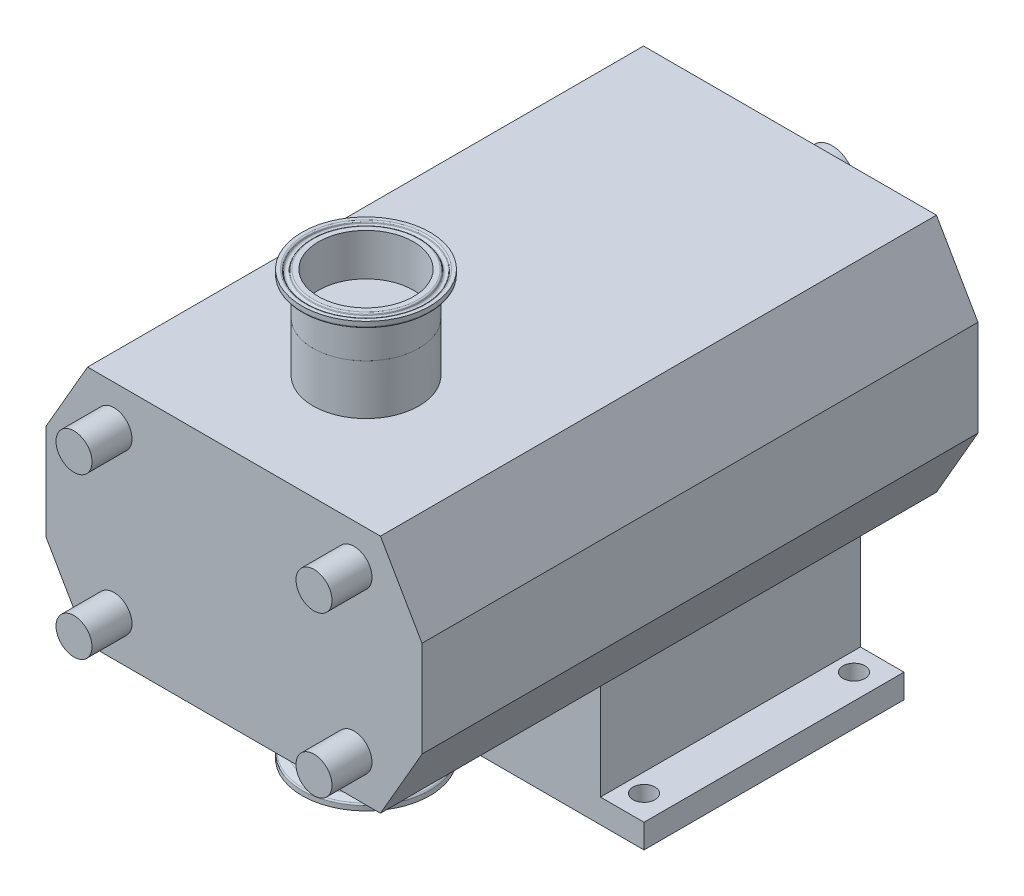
ISO-10303-21;
HEADER;
FILE_DESCRIPTION(('STEP AP214'),'2;1');
FILE_NAME('part.step','',(''),(''),'','','');
FILE_SCHEMA(('AUTOMOTIVE_DESIGN { 1 0 10303 214 1 1 1 1 }'));
ENDSEC;
DATA;
#1=APPLICATION_CONTEXT('core data for automotive mechanical design processes');
#2=APPLICATION_PROTOCOL_DEFINITION('international standard','automotive_design',2000,#1);
#3=PRODUCT_CONTEXT('',#1,'mechanical');
#4=PRODUCT('Part','Part','',(#3));
#5=PRODUCT_RELATED_PRODUCT_CATEGORY('part','',(#4));
#6=PRODUCT_DEFINITION_FORMATION('','',#4);
#7=PRODUCT_DEFINITION_CONTEXT('part definition',#1,'design');
#8=PRODUCT_DEFINITION('design','',#6,#7);
#9=PRODUCT_DEFINITION_SHAPE('','',#8);
#10=(LENGTH_UNIT() NAMED_UNIT(*) SI_UNIT(.MILLI.,.METRE.));
#11=(NAMED_UNIT(*) PLANE_ANGLE_UNIT() SI_UNIT($,.RADIAN.));
#12=(NAMED_UNIT(*) SI_UNIT($,.STERADIAN.) SOLID_ANGLE_UNIT());
#13=UNCERTAINTY_MEASURE_WITH_UNIT(LENGTH_MEASURE(1.E-05),#10,'distance_accuracy_value','');
#14=(GEOMETRIC_REPRESENTATION_CONTEXT(3) GLOBAL_UNCERTAINTY_ASSIGNED_CONTEXT((#13)) GLOBAL_UNIT_ASSIGNED_CONTEXT((#10,
#11,#12)) REPRESENTATION_CONTEXT('',''));
#15=CARTESIAN_POINT('',(0.,0.,0.));
#16=DIRECTION('',(0.,0.,1.));
#17=DIRECTION('',(1.,0.,0.));
#18=AXIS2_PLACEMENT_3D('',#15,#16,#17);
#19=CARTESIAN_POINT('',(13.9682163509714,-106.,238.835214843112));
#20=DIRECTION('',(0.,-1.,0.));
#21=DIRECTION('',(-0.887028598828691,0.,0.461714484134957));
#22=AXIS2_PLACEMENT_3D('',#19,#20,#21);
#23=PLANE('',#22);
#24=CARTESIAN_POINT('',(0.,-106.,212.));
#25=DIRECTION('',(0.,-1.,0.));
#26=DIRECTION('',(-0.887028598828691,0.,0.461714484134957));
#27=AXIS2_PLACEMENT_3D('',#24,#25,#26);
#28=CIRCLE('',#27,32.);
#29=CARTESIAN_POINT('',(-28.3849151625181,-106.,226.774863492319));
#30=VERTEX_POINT('',#29);
#31=EDGE_CURVE('P0_E9',#30,#30,#28,.T.);
#32=ORIENTED_EDGE('',*,*,#31,.T.);
#33=EDGE_LOOP('',(#32));
#34=FACE_BOUND('',#33,.T.);
#35=CARTESIAN_POINT('',(0.,-106.,212.));
#36=DIRECTION('',(0.,-1.,0.));
#37=DIRECTION('',(-0.887028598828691,0.,0.461714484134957));
#38=AXIS2_PLACEMENT_3D('',#35,#36,#37);
#39=CIRCLE('',#38,30.2529308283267);
#40=CARTESIAN_POINT('',(-26.8352148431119,-106.,225.968216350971));
#41=VERTEX_POINT('',#40);
#42=EDGE_CURVE('P0_E60',#41,#41,#39,.T.);
#43=ORIENTED_EDGE('',*,*,#42,.F.);
#44=EDGE_LOOP('',(#43));
#45=FACE_BOUND('',#44,.T.);
#46=ADVANCED_FACE('P0_F14',(#34,#45),#23,.T.);
#47=CARTESIAN_POINT('',(0.,-106.,212.));
#48=DIRECTION('',(0.,-1.,0.));
#49=DIRECTION('',(-0.887028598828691,0.,0.461714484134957));
#50=AXIS2_PLACEMENT_3D('',#47,#48,#49);
#51=CYLINDRICAL_SURFACE('',#50,32.);
#52=CARTESIAN_POINT('',(0.,-103.710166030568,212.));
#53=DIRECTION('',(0.,-1.,0.));
#54=DIRECTION('',(-0.887028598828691,0.,0.461714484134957));
#55=AXIS2_PLACEMENT_3D('',#52,#53,#54);
#56=CIRCLE('',#55,32.);
#57=CARTESIAN_POINT('',(-28.3849151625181,-103.710166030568,226.774863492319));
#58=VERTEX_POINT('',#57);
#59=EDGE_CURVE('P0_E20',#58,#58,#56,.T.);
#60=ORIENTED_EDGE('',*,*,#59,.T.);
#61=EDGE_LOOP('',(#60));
#62=FACE_BOUND('',#61,.T.);
#63=ORIENTED_EDGE('',*,*,#31,.F.);
#64=EDGE_LOOP('',(#63));
#65=FACE_BOUND('',#64,.T.);
#66=ADVANCED_FACE('P0_F68',(#62,#65),#51,.T.);
#67=CARTESIAN_POINT('',(0.,-103.710166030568,212.));
#68=DIRECTION('',(0.,-1.,0.));
#69=DIRECTION('',(-0.887028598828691,0.,0.461714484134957));
#70=AXIS2_PLACEMENT_3D('',#67,#68,#69);
#71=TOROIDAL_SURFACE('',#70,31.2,0.8);
#72=CARTESIAN_POINT('',(0.,-102.958411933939,212.));
#73=DIRECTION('',(0.,-1.,0.));
#74=DIRECTION('',(-0.887028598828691,0.,0.461714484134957));
#75=AXIS2_PLACEMENT_3D('',#72,#73,#74);
#76=CIRCLE('',#75,31.4736161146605);
#77=CARTESIAN_POINT('',(-27.9179976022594,-102.958411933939,226.531824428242));
#78=VERTEX_POINT('',#77);
#79=EDGE_CURVE('P0_E24',#78,#78,#76,.T.);
#80=ORIENTED_EDGE('',*,*,#79,.T.);
#81=EDGE_LOOP('',(#80));
#82=FACE_BOUND('',#81,.T.);
#83=ORIENTED_EDGE('',*,*,#59,.F.);
#84=EDGE_LOOP('',(#83));
#85=FACE_BOUND('',#84,.T.);
#86=ADVANCED_FACE('P0_F73',(#82,#85),#71,.T.);
#87=CARTESIAN_POINT('',(0.,-102.958411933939,212.));
#88=DIRECTION('',(0.,-1.,0.));
#89=DIRECTION('',(-0.887028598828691,0.,0.461714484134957));
#90=AXIS2_PLACEMENT_3D('',#87,#88,#89);
#91=CONICAL_SURFACE('',#90,31.4736161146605,1.22173047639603);
#92=CARTESIAN_POINT('',(0.,-101.627133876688,212.));
#93=DIRECTION('',(0.,-1.,0.));
#94=DIRECTION('',(-0.887028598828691,0.,0.461714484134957));
#95=AXIS2_PLACEMENT_3D('',#92,#93,#94);
#96=CIRCLE('',#95,27.8159597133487);
#97=CARTESIAN_POINT('',(-24.6735517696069,-101.627133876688,224.843031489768));
#98=VERTEX_POINT('',#97);
#99=EDGE_CURVE('P0_E28',#98,#98,#96,.T.);
#100=ORIENTED_EDGE('',*,*,#99,.T.);
#101=EDGE_LOOP('',(#100));
#102=FACE_BOUND('',#101,.T.);
#103=ORIENTED_EDGE('',*,*,#79,.F.);
#104=EDGE_LOOP('',(#103));
#105=FACE_BOUND('',#104,.T.);
#106=ADVANCED_FACE('P0_F77',(#102,#105),#91,.T.);
#107=CARTESIAN_POINT('',(0.,-99.7477486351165,212.));
#108=DIRECTION('',(0.,-1.,0.));
#109=DIRECTION('',(-0.887028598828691,0.,0.461714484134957));
#110=AXIS2_PLACEMENT_3D('',#107,#108,#109);
#111=TOROIDAL_SURFACE('',#110,28.5,2.);
#112=CARTESIAN_POINT('',(0.,-99.7477486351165,212.));
#113=DIRECTION('',(0.,-1.,0.));
#114=DIRECTION('',(-0.887028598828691,0.,0.461714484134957));
#115=AXIS2_PLACEMENT_3D('',#112,#113,#114);
#116=CIRCLE('',#115,26.5);
#117=CARTESIAN_POINT('',(-23.5062578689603,-99.7477486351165,224.235433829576));
#118=VERTEX_POINT('',#117);
#119=EDGE_CURVE('P0_E33',#118,#118,#116,.T.);
#120=ORIENTED_EDGE('',*,*,#119,.T.);
#121=EDGE_LOOP('',(#120));
#122=FACE_BOUND('',#121,.T.);
#123=ORIENTED_EDGE('',*,*,#99,.F.);
#124=EDGE_LOOP('',(#123));
#125=FACE_BOUND('',#124,.T.);
#126=ADVANCED_FACE('P0_F84',(#122,#125),#111,.F.);
#127=CARTESIAN_POINT('',(0.,-106.,212.));
#128=DIRECTION('',(0.,-1.,0.));
#129=DIRECTION('',(-0.887028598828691,0.,0.461714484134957));
#130=AXIS2_PLACEMENT_3D('',#127,#128,#129);
#131=CYLINDRICAL_SURFACE('',#130,26.5);
#132=CARTESIAN_POINT('',(0.,-85.,212.));
#133=DIRECTION('',(0.,-1.,0.));
#134=DIRECTION('',(-0.887028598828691,0.,0.461714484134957));
#135=AXIS2_PLACEMENT_3D('',#132,#133,#134);
#136=CIRCLE('',#135,26.5);
#137=CARTESIAN_POINT('',(-23.5062578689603,-85.,224.235433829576));
#138=VERTEX_POINT('',#137);
#139=EDGE_CURVE('P0_E36',#138,#138,#136,.T.);
#140=ORIENTED_EDGE('',*,*,#139,.T.);
#141=EDGE_LOOP('',(#140));
#142=FACE_BOUND('',#141,.T.);
#143=ORIENTED_EDGE('',*,*,#119,.F.);
#144=EDGE_LOOP('',(#143));
#145=FACE_BOUND('',#144,.T.);
#146=ADVANCED_FACE('P0_F88',(#142,#145),#131,.T.);
#147=CARTESIAN_POINT('',(10.9657189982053,-85.,233.066929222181));
#148=DIRECTION('',(0.,1.,0.));
#149=DIRECTION('',(0.887028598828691,0.,-0.461714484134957));
#150=AXIS2_PLACEMENT_3D('',#147,#148,#149);
#151=PLANE('',#150);
#152=CARTESIAN_POINT('',(0.,-85.,212.));
#153=DIRECTION('',(0.,-1.,0.));
#154=DIRECTION('',(-0.887028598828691,0.,0.461714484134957));
#155=AXIS2_PLACEMENT_3D('',#152,#153,#154);
#156=CIRCLE('',#155,23.75);
#157=CARTESIAN_POINT('',(-21.0669292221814,-85.,222.965718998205));
#158=VERTEX_POINT('',#157);
#159=EDGE_CURVE('P0_E39',#158,#158,#156,.T.);
#160=ORIENTED_EDGE('',*,*,#159,.T.);
#161=EDGE_LOOP('',(#160));
#162=FACE_BOUND('',#161,.T.);
#163=ORIENTED_EDGE('',*,*,#139,.F.);
#164=EDGE_LOOP('',(#163));
#165=FACE_BOUND('',#164,.T.);
#166=ADVANCED_FACE('P0_F92',(#162,#165),#151,.T.);
#167=CARTESIAN_POINT('',(0.,-106.,212.));
#168=DIRECTION('',(0.,-1.,0.));
#169=DIRECTION('',(-0.887028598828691,0.,0.461714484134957));
#170=AXIS2_PLACEMENT_3D('',#167,#168,#169);
#171=CYLINDRICAL_SURFACE('',#170,23.75);
#172=CARTESIAN_POINT('',(0.,-106.,212.));
#173=DIRECTION('',(0.,-1.,0.));
#174=DIRECTION('',(-0.887028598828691,0.,0.461714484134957));
#175=AXIS2_PLACEMENT_3D('',#172,#173,#174);
#176=CIRCLE('',#175,23.75);
#177=CARTESIAN_POINT('',(-21.0669292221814,-106.,222.965718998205));
#178=VERTEX_POINT('',#177);
#179=EDGE_CURVE('P0_E42',#178,#178,#176,.T.);
#180=ORIENTED_EDGE('',*,*,#179,.T.);
#181=EDGE_LOOP('',(#180));
#182=FACE_BOUND('',#181,.T.);
#183=ORIENTED_EDGE('',*,*,#159,.F.);
#184=EDGE_LOOP('',(#183));
#185=FACE_BOUND('',#184,.T.);
#186=ADVANCED_FACE('P0_F96',(#182,#185),#171,.F.);
#187=CARTESIAN_POINT('',(10.9657189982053,-106.,233.066929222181));
#188=DIRECTION('',(0.,-1.,0.));
#189=DIRECTION('',(-0.887028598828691,0.,0.461714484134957));
#190=AXIS2_PLACEMENT_3D('',#187,#188,#189);
#191=PLANE('',#190);
#192=CARTESIAN_POINT('',(0.,-106.,212.));
#193=DIRECTION('',(0.,-1.,0.));
#194=DIRECTION('',(-0.887028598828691,0.,0.461714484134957));
#195=AXIS2_PLACEMENT_3D('',#192,#193,#194);
#196=CIRCLE('',#195,26.2470691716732);
#197=CARTESIAN_POINT('',(-23.281900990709,-106.,224.118652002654));
#198=VERTEX_POINT('',#197);
#199=EDGE_CURVE('P0_E45',#198,#198,#196,.T.);
#200=ORIENTED_EDGE('',*,*,#199,.T.);
#201=EDGE_LOOP('',(#200));
#202=FACE_BOUND('',#201,.T.);
#203=ORIENTED_EDGE('',*,*,#179,.F.);
#204=EDGE_LOOP('',(#203));
#205=FACE_BOUND('',#204,.T.);
#206=ADVANCED_FACE('P0_F100',(#202,#205),#191,.T.);
#207=CARTESIAN_POINT('',(0.,-105.2,212.));
#208=DIRECTION('',(0.,-1.,0.));
#209=DIRECTION('',(-0.887028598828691,0.,0.461714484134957));
#210=AXIS2_PLACEMENT_3D('',#207,#208,#209);
#211=TOROIDAL_SURFACE('',#210,26.2470691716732,0.800000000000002);
#212=CARTESIAN_POINT('',(0.,-105.512584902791,212.));
#213=DIRECTION('',(0.,-1.,0.));
#214=DIRECTION('',(-0.887028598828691,0.,0.461714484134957));
#215=AXIS2_PLACEMENT_3D('',#212,#213,#214);
#216=CIRCLE('',#215,26.9834730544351);
#217=CARTESIAN_POINT('',(-23.9351122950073,-105.512584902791,224.458660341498));
#218=VERTEX_POINT('',#217);
#219=EDGE_CURVE('P0_E48',#218,#218,#216,.T.);
#220=ORIENTED_EDGE('',*,*,#219,.T.);
#221=EDGE_LOOP('',(#220));
#222=FACE_BOUND('',#221,.T.);
#223=ORIENTED_EDGE('',*,*,#199,.F.);
#224=EDGE_LOOP('',(#223));
#225=FACE_BOUND('',#224,.T.);
#226=ADVANCED_FACE('P0_F104',(#222,#225),#211,.T.);
#227=CARTESIAN_POINT('',(0.,-105.512584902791,212.));
#228=DIRECTION('',(0.,1.,0.));
#229=DIRECTION('',(0.887028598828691,0.,-0.461714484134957));
#230=AXIS2_PLACEMENT_3D('',#227,#228,#229);
#231=CONICAL_SURFACE('',#230,26.9834730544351,0.40142572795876);
#232=CARTESIAN_POINT('',(0.,-105.131122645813,212.));
#233=DIRECTION('',(0.,-1.,0.));
#234=DIRECTION('',(-0.887028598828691,0.,0.461714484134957));
#235=AXIS2_PLACEMENT_3D('',#232,#233,#234);
#236=CIRCLE('',#235,27.1453941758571);
#237=CARTESIAN_POINT('',(-24.078740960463,-105.131122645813,224.533421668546));
#238=VERTEX_POINT('',#237);
#239=EDGE_CURVE('P0_E51',#238,#238,#236,.T.);
#240=ORIENTED_EDGE('',*,*,#239,.T.);
#241=EDGE_LOOP('',(#240));
#242=FACE_BOUND('',#241,.T.);
#243=ORIENTED_EDGE('',*,*,#219,.F.);
#244=EDGE_LOOP('',(#243));
#245=FACE_BOUND('',#244,.T.);
#246=ADVANCED_FACE('P0_F108',(#242,#245),#231,.T.);
#247=CARTESIAN_POINT('',(0.,-105.6,212.));
#248=DIRECTION('',(0.,-1.,0.));
#249=DIRECTION('',(-0.887028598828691,0.,0.461714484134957));
#250=AXIS2_PLACEMENT_3D('',#247,#248,#249);
#251=TOROIDAL_SURFACE('',#250,28.25,1.2);
#252=CARTESIAN_POINT('',(0.,-105.131122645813,212.));
#253=DIRECTION('',(0.,-1.,0.));
#254=DIRECTION('',(-0.887028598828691,0.,0.461714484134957));
#255=AXIS2_PLACEMENT_3D('',#252,#253,#254);
#256=CIRCLE('',#255,29.354605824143);
#257=CARTESIAN_POINT('',(-26.038374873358,-105.131122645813,225.553446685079));
#258=VERTEX_POINT('',#257);
#259=EDGE_CURVE('P0_E54',#258,#258,#256,.T.);
#260=ORIENTED_EDGE('',*,*,#259,.T.);
#261=EDGE_LOOP('',(#260));
#262=FACE_BOUND('',#261,.T.);
#263=ORIENTED_EDGE('',*,*,#239,.F.);
#264=EDGE_LOOP('',(#263));
#265=FACE_BOUND('',#264,.T.);
#266=ADVANCED_FACE('P0_F112',(#262,#265),#251,.F.);
#267=CARTESIAN_POINT('',(0.,-105.131122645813,212.));
#268=DIRECTION('',(0.,-1.,0.));
#269=DIRECTION('',(-0.887028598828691,0.,0.461714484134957));
#270=AXIS2_PLACEMENT_3D('',#267,#268,#269);
#271=CONICAL_SURFACE('',#270,29.354605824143,0.401425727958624);
#272=CARTESIAN_POINT('',(0.,-105.512584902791,212.));
#273=DIRECTION('',(0.,-1.,0.));
#274=DIRECTION('',(-0.887028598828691,0.,0.461714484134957));
#275=AXIS2_PLACEMENT_3D('',#272,#273,#274);
#276=CIRCLE('',#275,29.5165269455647);
#277=CARTESIAN_POINT('',(-26.1820035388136,-105.512584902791,225.628208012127));
#278=VERTEX_POINT('',#277);
#279=EDGE_CURVE('P0_E57',#278,#278,#276,.T.);
#280=ORIENTED_EDGE('',*,*,#279,.T.);
#281=EDGE_LOOP('',(#280));
#282=FACE_BOUND('',#281,.T.);
#283=ORIENTED_EDGE('',*,*,#259,.F.);
#284=EDGE_LOOP('',(#283));
#285=FACE_BOUND('',#284,.T.);
#286=ADVANCED_FACE('P0_F116',(#282,#285),#271,.F.);
#287=CARTESIAN_POINT('',(0.,-105.2,212.));
#288=DIRECTION('',(0.,-1.,0.));
#289=DIRECTION('',(-0.887028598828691,0.,0.461714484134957));
#290=AXIS2_PLACEMENT_3D('',#287,#288,#289);
#291=TOROIDAL_SURFACE('',#290,30.2529308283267,0.8);
#292=ORIENTED_EDGE('',*,*,#42,.T.);
#293=EDGE_LOOP('',(#292));
#294=FACE_BOUND('',#293,.T.);
#295=ORIENTED_EDGE('',*,*,#279,.F.);
#296=EDGE_LOOP('',(#295));
#297=FACE_BOUND('',#296,.T.);
#298=ADVANCED_FACE('P0_F64',(#294,#297),#291,.T.);
#299=CLOSED_SHELL('',(#46,#66,#86,#106,#126,#146,#166,#186,#206,#226,#246,#266,#286,#298));
#300=MANIFOLD_SOLID_BREP('P0_B1',#299);
#301=CARTESIAN_POINT('',(-31.,0.,241.732657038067));
#302=DIRECTION('',(0.,0.,1.));
#303=DIRECTION('',(1.,0.,0.));
#304=AXIS2_PLACEMENT_3D('',#301,#302,#303);
#305=CYLINDRICAL_SURFACE('',#304,12.);
#306=CARTESIAN_POINT('',(-31.,0.,-2.));
#307=DIRECTION('',(0.,0.,1.));
#308=DIRECTION('',(1.,0.,0.));
#309=AXIS2_PLACEMENT_3D('',#306,#307,#308);
#310=CIRCLE('',#309,12.);
#311=CARTESIAN_POINT('',(-19.,0.,-2.));
#312=VERTEX_POINT('',#311);
#313=EDGE_CURVE('P1_E277',#312,#312,#310,.T.);
#314=ORIENTED_EDGE('',*,*,#313,.F.);
#315=EDGE_LOOP('',(#314));
#316=FACE_BOUND('',#315,.T.);
#317=DIRECTION('',(0.,0.,1.));
#318=VECTOR('',#317,1.);
#319=CARTESIAN_POINT('',(-19.6862915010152,3.99999999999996,241.732657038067));
#320=LINE('',#319,#318);
#321=CARTESIAN_POINT('',(-19.6862915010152,4.,-52.));
#322=VERTEX_POINT('',#321);
#323=CARTESIAN_POINT('',(-19.6862915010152,4.,-22.));
#324=VERTEX_POINT('',#323);
#325=EDGE_CURVE('P1_E178',#322,#324,#320,.T.);
#326=ORIENTED_EDGE('',*,*,#325,.F.);
#327=CARTESIAN_POINT('',(-31.,0.,-52.));
#328=DIRECTION('',(0.,0.,1.));
#329=DIRECTION('',(1.,0.,0.));
#330=AXIS2_PLACEMENT_3D('',#327,#328,#329);
#331=CIRCLE('',#330,12.);
#332=CARTESIAN_POINT('',(-19.6862915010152,-4.,-52.));
#333=VERTEX_POINT('',#332);
#334=EDGE_CURVE('P1_E176',#322,#333,#331,.T.);
#335=ORIENTED_EDGE('',*,*,#334,.T.);
#336=DIRECTION('',(0.,0.,1.));
#337=VECTOR('',#336,1.);
#338=CARTESIAN_POINT('',(-19.6862915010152,-4.00000000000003,241.732657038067));
#339=LINE('',#338,#337);
#340=CARTESIAN_POINT('',(-19.6862915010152,-4.00000000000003,-22.));
#341=VERTEX_POINT('',#340);
#342=EDGE_CURVE('P1_E39',#341,#333,#339,.F.);
#343=ORIENTED_EDGE('',*,*,#342,.F.);
#344=CARTESIAN_POINT('',(-19.,0.,-26.));
#345=CARTESIAN_POINT('',(-18.9999993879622,0.218253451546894,-26.0000010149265));
#346=CARTESIAN_POINT('',(-19.0060092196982,0.436500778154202,-25.9820789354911));
#347=CARTESIAN_POINT('',(-19.0293915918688,0.866567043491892,-25.9110835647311));
#348=CARTESIAN_POINT('',(-19.0467653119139,1.07838531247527,-25.8580066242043));
#349=CARTESIAN_POINT('',(-19.0909876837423,1.4893311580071,-25.7187230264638));
#350=CARTESIAN_POINT('',(-19.1178204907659,1.68847930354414,-25.6325717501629));
#351=CARTESIAN_POINT('',(-19.1782221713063,2.0694997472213,-25.4298353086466));
#352=CARTESIAN_POINT('',(-19.2117923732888,2.25136862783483,-25.3132441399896));
#353=CARTESIAN_POINT('',(-19.2834362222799,2.59896670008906,-25.048696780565));
#354=CARTESIAN_POINT('',(-19.3216177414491,2.76401480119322,-24.899875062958));
#355=CARTESIAN_POINT('',(-19.3975874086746,3.06733077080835,-24.5769313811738));
#356=CARTESIAN_POINT('',(-19.4353754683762,3.20559274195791,-24.4028038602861));
#357=CARTESIAN_POINT('',(-19.5074667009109,3.45529976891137,-24.028059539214));
#358=CARTESIAN_POINT('',(-19.5416384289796,3.56585943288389,-23.826825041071));
#359=CARTESIAN_POINT('',(-19.6009877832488,3.75127549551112,-23.4072956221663));
#360=CARTESIAN_POINT('',(-19.6261681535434,3.82614278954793,-23.1890059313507));
#361=CARTESIAN_POINT('',(-19.6635478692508,3.93549384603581,-22.7493071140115));
#362=CARTESIAN_POINT('',(-19.6761561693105,3.97125379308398,-22.5282511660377));
#363=CARTESIAN_POINT('',(-19.6881737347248,4.005364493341,-22.0829449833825));
#364=CARTESIAN_POINT('',(-19.687587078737,4.00372680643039,-21.8586957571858));
#365=CARTESIAN_POINT('',(-19.6736394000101,3.96407961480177,-21.4242534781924));
#366=CARTESIAN_POINT('',(-19.6608633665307,3.92773565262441,-21.2138863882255));
#367=CARTESIAN_POINT('',(-19.6249336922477,3.82242465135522,-20.8024263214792));
#368=CARTESIAN_POINT('',(-19.6017788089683,3.75345370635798,-20.601334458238));
#369=CARTESIAN_POINT('',(-19.5472835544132,3.58375623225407,-20.2103490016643));
#370=CARTESIAN_POINT('',(-19.5158173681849,3.48253619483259,-20.02068789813));
#371=CARTESIAN_POINT('',(-19.4482976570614,3.251556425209,-19.660516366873));
#372=CARTESIAN_POINT('',(-19.4122428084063,3.12178844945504,-19.4900114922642));
#373=CARTESIAN_POINT('',(-19.3373068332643,2.82939733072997,-19.1636336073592));
#374=CARTESIAN_POINT('',(-19.2983764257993,2.66541260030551,-19.0089892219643));
#375=CARTESIAN_POINT('',(-19.2237224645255,2.31335827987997,-18.7290749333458));
#376=CARTESIAN_POINT('',(-19.1879992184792,2.12528638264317,-18.6038078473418));
#377=CARTESIAN_POINT('',(-19.1233156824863,1.72779045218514,-18.3852147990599));
#378=CARTESIAN_POINT('',(-19.0944259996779,1.51817310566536,-18.2922180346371));
#379=CARTESIAN_POINT('',(-19.0471773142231,1.085076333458,-18.1431873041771));
#380=CARTESIAN_POINT('',(-19.028814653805,0.8616017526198,-18.0871404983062));
#381=CARTESIAN_POINT('',(-19.0052949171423,0.417535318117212,-18.0157773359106));
#382=CARTESIAN_POINT('',(-18.9995999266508,0.197238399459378,-17.998800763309));
#383=CARTESIAN_POINT('',(-19.0004438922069,-0.243100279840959,-18.0013306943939));
#384=CARTESIAN_POINT('',(-19.0069807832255,-0.46314207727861,-18.0208310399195));
#385=CARTESIAN_POINT('',(-19.0311990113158,-0.89007946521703,-18.0944476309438));
#386=CARTESIAN_POINT('',(-19.0485520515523,-1.09717122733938,-18.147544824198));
#387=CARTESIAN_POINT('',(-19.0923261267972,-1.4994238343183,-18.2855737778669));
#388=CARTESIAN_POINT('',(-19.118748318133,-1.69458315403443,-18.3705095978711));
#389=CARTESIAN_POINT('',(-19.1788427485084,-2.0731531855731,-18.5722817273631));
#390=CARTESIAN_POINT('',(-19.2126874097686,-2.25611983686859,-18.6898983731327));
#391=CARTESIAN_POINT('',(-19.2837898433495,-2.60025932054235,-18.9527766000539));
#392=CARTESIAN_POINT('',(-19.3210486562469,-2.76142547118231,-19.0980466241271));
#393=CARTESIAN_POINT('',(-19.3969260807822,-3.0650100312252,-19.4199150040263));
#394=CARTESIAN_POINT('',(-19.4355295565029,-3.20624387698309,-19.5976369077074));
#395=CARTESIAN_POINT('',(-19.5080010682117,-3.4570300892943,-19.9750862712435));
#396=CARTESIAN_POINT('',(-19.5418690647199,-3.56658219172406,-20.1748139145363));
#397=CARTESIAN_POINT('',(-19.6007043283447,-3.75038772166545,-20.5906920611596));
#398=CARTESIAN_POINT('',(-19.6256895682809,-3.82471252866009,-20.8068083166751));
#399=CARTESIAN_POINT('',(-19.663566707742,-3.93557866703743,-21.2495146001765));
#400=CARTESIAN_POINT('',(-19.6764640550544,-3.97213701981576,-21.4760998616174));
#401=CARTESIAN_POINT('',(-19.6880856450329,-4.00510512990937,-21.9207883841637));
#402=CARTESIAN_POINT('',(-19.6875039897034,-4.0034810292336,-22.1387293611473));
#403=CARTESIAN_POINT('',(-19.6739492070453,-3.96496917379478,-22.5710602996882));
#404=CARTESIAN_POINT('',(-19.6609768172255,-3.92808351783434,-22.7854504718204));
#405=CARTESIAN_POINT('',(-19.6246190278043,-3.82148725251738,-23.2005426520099));
#406=CARTESIAN_POINT('',(-19.6014360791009,-3.75241338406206,-23.401427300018));
#407=CARTESIAN_POINT('',(-19.5473440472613,-3.58391746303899,-23.7889096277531));
#408=CARTESIAN_POINT('',(-19.5164332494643,-3.48448867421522,-23.975504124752));
#409=CARTESIAN_POINT('',(-19.4486868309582,-3.25304277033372,-24.3379346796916));
#410=CARTESIAN_POINT('',(-19.4116515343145,-3.11979297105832,-24.5129460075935));
#411=CARTESIAN_POINT('',(-19.3366657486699,-2.8265715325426,-24.8387592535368));
#412=CARTESIAN_POINT('',(-19.2987150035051,-2.66659233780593,-24.9895543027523));
#413=CARTESIAN_POINT('',(-19.2243987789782,-2.31696622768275,-25.2685776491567));
#414=CARTESIAN_POINT('',(-19.1881527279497,-2.12640605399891,-25.395697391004));
#415=CARTESIAN_POINT('',(-19.1229603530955,-1.7254294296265,-25.6159617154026));
#416=CARTESIAN_POINT('',(-19.0940121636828,-1.51501807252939,-25.7091149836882));
#417=CARTESIAN_POINT('',(-19.0477793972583,-1.0899745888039,-25.8548865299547));
#418=CARTESIAN_POINT('',(-19.0300315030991,-0.875951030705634,-25.9091298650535));
#419=CARTESIAN_POINT('',(-19.0061437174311,-0.441281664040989,-25.9816811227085));
#420=CARTESIAN_POINT('',(-19.0000006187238,-0.220637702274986,-25.9999989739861));
#421=CARTESIAN_POINT('',(-19.,0.,-26.));
#422=B_SPLINE_CURVE_WITH_KNOTS('',3,(#344,#345,#346,#347,#348,#349,#350,#351,#352,#353,#354,
#355,#356,#357,#358,#359,#360,#361,#362,#363,#364,#365,#366,#367,#368,#369,#370,#371,#372,#373,
#374,#375,#376,#377,#378,#379,#380,#381,#382,#383,#384,#385,#386,#387,#388,#389,#390,#391,#392,
#393,#394,#395,#396,#397,#398,#399,#400,#401,#402,#403,#404,#405,#406,#407,#408,#409,#410,#411,
#412,#413,#414,#415,#416,#417,#418,#419,#420,#421),.UNSPECIFIED.,.T.,.F.,(4,2,2,2,2,2,2,2,2,2,2,
2,2,2,2,2,2,2,2,2,2,2,2,2,2,2,2,2,2,2,2,2,2,2,2,2,2,2,4),(0.,0.653948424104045,1.30796474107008,
1.96089069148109,2.6139455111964,3.28738737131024,3.96097733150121,4.65393539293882,
5.34668178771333,6.01607702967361,6.68526535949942,7.32387306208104,7.96255723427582,
8.61152684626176,9.26068410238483,9.94373223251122,10.6268458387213,11.3167362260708,
12.0063867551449,12.6661433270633,13.3257885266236,13.9663263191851,14.6069458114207,
15.264415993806,15.9220872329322,16.6096409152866,17.2972003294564,17.9833605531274,
18.6692113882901,19.3198266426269,19.9704031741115,20.6086234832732,21.2469855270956,
21.9132026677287,22.5796084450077,23.2719864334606,23.9641872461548,24.6254623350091,
25.2865546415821),.UNSPECIFIED.);
#423=EDGE_CURVE('P1_E11',#324,#341,#422,.T.);
#424=ORIENTED_EDGE('',*,*,#423,.F.);
#425=EDGE_LOOP('',(#326,#335,#343,#424));
#426=FACE_BOUND('',#425,.T.);
#427=ADVANCED_FACE('P1_F17',(#316,#426),#305,.T.);
#428=CARTESIAN_POINT('',(-73.2153903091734,-60.,278.));
#429=DIRECTION('',(0.,1.,0.));
#430=DIRECTION('',(-1.,0.,0.));
#431=AXIS2_PLACEMENT_3D('',#428,#429,#430);
#432=PLANE('',#431);
#433=CARTESIAN_POINT('',(0.,-60.,212.));
#434=DIRECTION('',(0.,1.,0.));
#435=DIRECTION('',(-1.,0.,0.));
#436=AXIS2_PLACEMENT_3D('',#433,#434,#435);
#437=CIRCLE('',#436,26.5);
#438=CARTESIAN_POINT('',(-26.5,-60.,212.));
#439=VERTEX_POINT('',#438);
#440=EDGE_CURVE('P1_E192',#439,#439,#437,.T.);
#441=ORIENTED_EDGE('',*,*,#440,.T.);
#442=EDGE_LOOP('',(#441));
#443=FACE_BOUND('',#442,.T.);
#444=DIRECTION('',(1.,0.,0.));
#445=VECTOR('',#444,1.);
#446=CARTESIAN_POINT('',(-73.2153903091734,-60.,0.));
#447=LINE('',#446,#445);
#448=CARTESIAN_POINT('',(-73.2153903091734,-60.,0.));
#449=VERTEX_POINT('',#448);
#450=CARTESIAN_POINT('',(73.2153903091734,-60.,0.));
#451=VERTEX_POINT('',#450);
#452=EDGE_CURVE('P1_E337',#449,#451,#447,.T.);
#453=ORIENTED_EDGE('',*,*,#452,.T.);
#454=DIRECTION('',(0.,0.,-1.));
#455=VECTOR('',#454,1.);
#456=CARTESIAN_POINT('',(73.2153903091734,-60.,278.));
#457=LINE('',#456,#455);
#458=CARTESIAN_POINT('',(73.2153903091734,-60.,278.));
#459=VERTEX_POINT('',#458);
#460=EDGE_CURVE('P1_E347',#459,#451,#457,.T.);
#461=ORIENTED_EDGE('',*,*,#460,.F.);
#462=DIRECTION('',(1.,0.,0.));
#463=VECTOR('',#462,1.);
#464=CARTESIAN_POINT('',(-73.2153903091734,-60.,278.));
#465=LINE('',#464,#463);
#466=CARTESIAN_POINT('',(-73.2153903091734,-60.,278.));
#467=VERTEX_POINT('',#466);
#468=EDGE_CURVE('P1_E320',#467,#459,#465,.T.);
#469=ORIENTED_EDGE('',*,*,#468,.F.);
#470=DIRECTION('',(0.,0.,-1.));
#471=VECTOR('',#470,1.);
#472=CARTESIAN_POINT('',(-73.2153903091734,-60.,278.));
#473=LINE('',#472,#471);
#474=EDGE_CURVE('P1_E350',#467,#449,#473,.T.);
#475=ORIENTED_EDGE('',*,*,#474,.T.);
#476=EDGE_LOOP('',(#453,#461,#469,#475));
#477=FACE_BOUND('',#476,.T.);
#478=DIRECTION('',(1.,0.,0.));
#479=VECTOR('',#478,1.);
#480=CARTESIAN_POINT('',(53.2153903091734,-60.,18.));
#481=LINE('',#480,#479);
#482=CARTESIAN_POINT('',(-53.2153903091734,-60.,18.));
#483=VERTEX_POINT('',#482);
#484=CARTESIAN_POINT('',(53.2153903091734,-60.,18.));
#485=VERTEX_POINT('',#484);
#486=EDGE_CURVE('P1_E220',#483,#485,#481,.T.);
#487=ORIENTED_EDGE('',*,*,#486,.F.);
#488=DIRECTION('',(0.,0.,1.));
#489=VECTOR('',#488,1.);
#490=CARTESIAN_POINT('',(-53.2153903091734,-60.,18.));
#491=LINE('',#490,#489);
#492=CARTESIAN_POINT('',(-53.2153903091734,-60.,148.));
#493=VERTEX_POINT('',#492);
#494=EDGE_CURVE('P1_E238',#483,#493,#491,.T.);
#495=ORIENTED_EDGE('',*,*,#494,.T.);
#496=DIRECTION('',(1.,0.,0.));
#497=VECTOR('',#496,1.);
#498=CARTESIAN_POINT('',(53.2153903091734,-60.,148.));
#499=LINE('',#498,#497);
#500=CARTESIAN_POINT('',(53.2153903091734,-60.,148.));
#501=VERTEX_POINT('',#500);
#502=EDGE_CURVE('P1_E219',#493,#501,#499,.T.);
#503=ORIENTED_EDGE('',*,*,#502,.T.);
#504=DIRECTION('',(0.,0.,1.));
#505=VECTOR('',#504,1.);
#506=CARTESIAN_POINT('',(53.2153903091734,-60.,18.));
#507=LINE('',#506,#505);
#508=EDGE_CURVE('P1_E274',#485,#501,#507,.T.);
#509=ORIENTED_EDGE('',*,*,#508,.F.);
#510=EDGE_LOOP('',(#487,#495,#503,#509));
#511=FACE_BOUND('',#510,.T.);
#512=ADVANCED_FACE('P1_F393',(#443,#477,#511),#432,.F.);
#513=CARTESIAN_POINT('',(107.856406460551,0.,0.));
#514=DIRECTION('',(0.,0.,1.));
#515=DIRECTION('',(1.,0.,0.));
#516=AXIS2_PLACEMENT_3D('',#513,#514,#515);
#517=PLANE('',#516);
#518=DIRECTION('',(-0.500000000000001,0.866025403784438,0.));
#519=VECTOR('',#518,1.);
#520=CARTESIAN_POINT('',(73.2153903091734,60.,0.));
#521=LINE('',#520,#519);
#522=CARTESIAN_POINT('',(94.,24.,0.));
#523=VERTEX_POINT('',#522);
#524=CARTESIAN_POINT('',(73.2153903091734,60.,0.));
#525=VERTEX_POINT('',#524);
#526=EDGE_CURVE('P1_E305',#523,#525,#521,.T.);
#527=ORIENTED_EDGE('',*,*,#526,.F.);
#528=DIRECTION('',(0.,1.,0.));
#529=VECTOR('',#528,1.);
#530=CARTESIAN_POINT('',(94.,24.,0.));
#531=LINE('',#530,#529);
#532=CARTESIAN_POINT('',(94.,-24.,0.));
#533=VERTEX_POINT('',#532);
#534=EDGE_CURVE('P1_E312',#533,#523,#531,.T.);
#535=ORIENTED_EDGE('',*,*,#534,.F.);
#536=DIRECTION('',(0.500000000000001,0.866025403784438,0.));
#537=VECTOR('',#536,1.);
#538=CARTESIAN_POINT('',(73.2153903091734,-60.,0.));
#539=LINE('',#538,#537);
#540=EDGE_CURVE('P1_E339',#451,#533,#539,.T.);
#541=ORIENTED_EDGE('',*,*,#540,.F.);
#542=ORIENTED_EDGE('',*,*,#452,.F.);
#543=DIRECTION('',(0.500000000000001,-0.866025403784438,0.));
#544=VECTOR('',#543,1.);
#545=CARTESIAN_POINT('',(-73.2153903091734,-60.,0.));
#546=LINE('',#545,#544);
#547=CARTESIAN_POINT('',(-94.,-24.,0.));
#548=VERTEX_POINT('',#547);
#549=EDGE_CURVE('P1_E335',#548,#449,#546,.T.);
#550=ORIENTED_EDGE('',*,*,#549,.F.);
#551=DIRECTION('',(0.,-1.,0.));
#552=VECTOR('',#551,1.);
#553=CARTESIAN_POINT('',(-94.,24.,0.));
#554=LINE('',#553,#552);
#555=CARTESIAN_POINT('',(-94.,24.,0.));
#556=VERTEX_POINT('',#555);
#557=EDGE_CURVE('P1_E333',#556,#548,#554,.T.);
#558=ORIENTED_EDGE('',*,*,#557,.F.);
#559=DIRECTION('',(-0.500000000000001,-0.866025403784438,0.));
#560=VECTOR('',#559,1.);
#561=CARTESIAN_POINT('',(-73.2153903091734,60.,0.));
#562=LINE('',#561,#560);
#563=CARTESIAN_POINT('',(-73.2153903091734,60.,0.));
#564=VERTEX_POINT('',#563);
#565=EDGE_CURVE('P1_E331',#564,#556,#562,.T.);
#566=ORIENTED_EDGE('',*,*,#565,.F.);
#567=DIRECTION('',(-1.,0.,0.));
#568=VECTOR('',#567,1.);
#569=CARTESIAN_POINT('',(-73.2153903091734,60.,0.));
#570=LINE('',#569,#568);
#571=EDGE_CURVE('P1_E329',#525,#564,#570,.T.);
#572=ORIENTED_EDGE('',*,*,#571,.F.);
#573=EDGE_LOOP('',(#527,#535,#541,#542,#550,#558,#566,#572));
#574=FACE_BOUND('',#573,.T.);
#575=CARTESIAN_POINT('',(-31.,0.,0.));
#576=DIRECTION('',(0.,0.,1.));
#577=DIRECTION('',(1.,0.,0.));
#578=AXIS2_PLACEMENT_3D('',#575,#576,#577);
#579=CIRCLE('',#578,15.);
#580=CARTESIAN_POINT('',(-16.,0.,0.));
#581=VERTEX_POINT('',#580);
#582=EDGE_CURVE('P1_E29',#581,#581,#579,.F.);
#583=ORIENTED_EDGE('',*,*,#582,.F.);
#584=EDGE_LOOP('',(#583));
#585=FACE_BOUND('',#584,.T.);
#586=ADVANCED_FACE('P1_F399',(#574,#585),#517,.F.);
#587=CARTESIAN_POINT('',(107.856406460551,0.,278.));
#588=DIRECTION('',(0.,0.,1.));
#589=DIRECTION('',(1.,0.,0.));
#590=AXIS2_PLACEMENT_3D('',#587,#588,#589);
#591=PLANE('',#590);
#592=CARTESIAN_POINT('',(60.,-40.,278.));
#593=DIRECTION('',(0.,0.,1.));
#594=DIRECTION('',(1.,0.,0.));
#595=AXIS2_PLACEMENT_3D('',#592,#593,#594);
#596=CIRCLE('',#595,9.);
#597=CARTESIAN_POINT('',(69.,-40.,278.));
#598=VERTEX_POINT('',#597);
#599=EDGE_CURVE('P1_E287',#598,#598,#596,.T.);
#600=ORIENTED_EDGE('',*,*,#599,.F.);
#601=EDGE_LOOP('',(#600));
#602=FACE_BOUND('',#601,.T.);
#603=CARTESIAN_POINT('',(-60.,40.,278.));
#604=DIRECTION('',(0.,0.,1.));
#605=DIRECTION('',(1.,0.,0.));
#606=AXIS2_PLACEMENT_3D('',#603,#604,#605);
#607=CIRCLE('',#606,9.);
#608=CARTESIAN_POINT('',(-51.,40.,278.));
#609=VERTEX_POINT('',#608);
#610=EDGE_CURVE('P1_E299',#609,#609,#607,.T.);
#611=ORIENTED_EDGE('',*,*,#610,.F.);
#612=EDGE_LOOP('',(#611));
#613=FACE_BOUND('',#612,.T.);
#614=DIRECTION('',(-0.500000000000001,0.866025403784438,0.));
#615=VECTOR('',#614,1.);
#616=CARTESIAN_POINT('',(73.2153903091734,60.,278.));
#617=LINE('',#616,#615);
#618=CARTESIAN_POINT('',(94.,24.,278.));
#619=VERTEX_POINT('',#618);
#620=CARTESIAN_POINT('',(73.2153903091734,60.,278.));
#621=VERTEX_POINT('',#620);
#622=EDGE_CURVE('P1_E308',#619,#621,#617,.T.);
#623=ORIENTED_EDGE('',*,*,#622,.T.);
#624=DIRECTION('',(-1.,0.,0.));
#625=VECTOR('',#624,1.);
#626=CARTESIAN_POINT('',(-73.2153903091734,60.,278.));
#627=LINE('',#626,#625);
#628=CARTESIAN_POINT('',(-73.2153903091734,60.,278.));
#629=VERTEX_POINT('',#628);
#630=EDGE_CURVE('P1_E311',#621,#629,#627,.T.);
#631=ORIENTED_EDGE('',*,*,#630,.T.);
#632=DIRECTION('',(-0.500000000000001,-0.866025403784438,0.));
#633=VECTOR('',#632,1.);
#634=CARTESIAN_POINT('',(-73.2153903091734,60.,278.));
#635=LINE('',#634,#633);
#636=CARTESIAN_POINT('',(-94.,24.,278.));
#637=VERTEX_POINT('',#636);
#638=EDGE_CURVE('P1_E314',#629,#637,#635,.T.);
#639=ORIENTED_EDGE('',*,*,#638,.T.);
#640=DIRECTION('',(0.,-1.,0.));
#641=VECTOR('',#640,1.);
#642=CARTESIAN_POINT('',(-94.,24.,278.));
#643=LINE('',#642,#641);
#644=CARTESIAN_POINT('',(-94.,-24.,278.));
#645=VERTEX_POINT('',#644);
#646=EDGE_CURVE('P1_E316',#637,#645,#643,.T.);
#647=ORIENTED_EDGE('',*,*,#646,.T.);
#648=DIRECTION('',(0.500000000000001,-0.866025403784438,0.));
#649=VECTOR('',#648,1.);
#650=CARTESIAN_POINT('',(-73.2153903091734,-60.,278.));
#651=LINE('',#650,#649);
#652=EDGE_CURVE('P1_E318',#645,#467,#651,.T.);
#653=ORIENTED_EDGE('',*,*,#652,.T.);
#654=ORIENTED_EDGE('',*,*,#468,.T.);
#655=DIRECTION('',(0.500000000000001,0.866025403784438,0.));
#656=VECTOR('',#655,1.);
#657=CARTESIAN_POINT('',(73.2153903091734,-60.,278.));
#658=LINE('',#657,#656);
#659=CARTESIAN_POINT('',(94.,-24.,278.));
#660=VERTEX_POINT('',#659);
#661=EDGE_CURVE('P1_E322',#459,#660,#658,.T.);
#662=ORIENTED_EDGE('',*,*,#661,.T.);
#663=DIRECTION('',(0.,1.,0.));
#664=VECTOR('',#663,1.);
#665=CARTESIAN_POINT('',(94.,24.,278.));
#666=LINE('',#665,#664);
#667=EDGE_CURVE('P1_E324',#660,#619,#666,.T.);
#668=ORIENTED_EDGE('',*,*,#667,.T.);
#669=EDGE_LOOP('',(#623,#631,#639,#647,#653,#654,#662,#668));
#670=FACE_BOUND('',#669,.T.);
#671=CARTESIAN_POINT('',(60.,40.,278.));
#672=DIRECTION('',(0.,0.,1.));
#673=DIRECTION('',(1.,0.,0.));
#674=AXIS2_PLACEMENT_3D('',#671,#672,#673);
#675=CIRCLE('',#674,9.);
#676=CARTESIAN_POINT('',(69.,40.,278.));
#677=VERTEX_POINT('',#676);
#678=EDGE_CURVE('P1_E293',#677,#677,#675,.T.);
#679=ORIENTED_EDGE('',*,*,#678,.F.);
#680=EDGE_LOOP('',(#679));
#681=FACE_BOUND('',#680,.T.);
#682=CARTESIAN_POINT('',(-60.,-40.,278.));
#683=DIRECTION('',(0.,0.,1.));
#684=DIRECTION('',(1.,0.,0.));
#685=AXIS2_PLACEMENT_3D('',#682,#683,#684);
#686=CIRCLE('',#685,9.);
#687=CARTESIAN_POINT('',(-51.,-40.,278.));
#688=VERTEX_POINT('',#687);
#689=EDGE_CURVE('P1_E283',#688,#688,#686,.T.);
#690=ORIENTED_EDGE('',*,*,#689,.F.);
#691=EDGE_LOOP('',(#690));
#692=FACE_BOUND('',#691,.T.);
#693=ADVANCED_FACE('P1_F448',(#602,#613,#670,#681,#692),#591,.T.);
#694=CARTESIAN_POINT('',(73.2153903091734,60.,278.));
#695=DIRECTION('',(-0.866025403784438,-0.500000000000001,0.));
#696=DIRECTION('',(0.500000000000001,-0.866025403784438,0.));
#697=AXIS2_PLACEMENT_3D('',#694,#695,#696);
#698=PLANE('',#697);
#699=ORIENTED_EDGE('',*,*,#526,.T.);
#700=DIRECTION('',(0.,0.,-1.));
#701=VECTOR('',#700,1.);
#702=CARTESIAN_POINT('',(73.2153903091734,60.,278.));
#703=LINE('',#702,#701);
#704=EDGE_CURVE('P1_E362',#621,#525,#703,.T.);
#705=ORIENTED_EDGE('',*,*,#704,.F.);
#706=ORIENTED_EDGE('',*,*,#622,.F.);
#707=DIRECTION('',(0.,0.,-1.));
#708=VECTOR('',#707,1.);
#709=CARTESIAN_POINT('',(94.,24.,278.));
#710=LINE('',#709,#708);
#711=EDGE_CURVE('P1_E326',#619,#523,#710,.T.);
#712=ORIENTED_EDGE('',*,*,#711,.T.);
#713=EDGE_LOOP('',(#699,#705,#706,#712));
#714=FACE_BOUND('',#713,.T.);
#715=ADVANCED_FACE('P1_F19',(#714),#698,.F.);
#716=CARTESIAN_POINT('',(-73.2153903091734,60.,278.));
#717=DIRECTION('',(0.,-1.,0.));
#718=DIRECTION('',(1.,0.,0.));
#719=AXIS2_PLACEMENT_3D('',#716,#717,#718);
#720=PLANE('',#719);
#721=CARTESIAN_POINT('',(0.,60.,212.));
#722=DIRECTION('',(0.,-1.,0.));
#723=DIRECTION('',(1.,0.,0.));
#724=AXIS2_PLACEMENT_3D('',#721,#722,#723);
#725=CIRCLE('',#724,26.5);
#726=CARTESIAN_POINT('',(26.5,60.,212.));
#727=VERTEX_POINT('',#726);
#728=EDGE_CURVE('P1_E191',#727,#727,#725,.T.);
#729=ORIENTED_EDGE('',*,*,#728,.T.);
#730=EDGE_LOOP('',(#729));
#731=FACE_BOUND('',#730,.T.);
#732=ORIENTED_EDGE('',*,*,#571,.T.);
#733=DIRECTION('',(0.,0.,-1.));
#734=VECTOR('',#733,1.);
#735=CARTESIAN_POINT('',(-73.2153903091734,60.,278.));
#736=LINE('',#735,#734);
#737=EDGE_CURVE('P1_E359',#629,#564,#736,.T.);
#738=ORIENTED_EDGE('',*,*,#737,.F.);
#739=ORIENTED_EDGE('',*,*,#630,.F.);
#740=ORIENTED_EDGE('',*,*,#704,.T.);
#741=EDGE_LOOP('',(#732,#738,#739,#740));
#742=FACE_BOUND('',#741,.T.);
#743=ADVANCED_FACE('P1_F369',(#731,#742),#720,.F.);
#744=CARTESIAN_POINT('',(-73.2153903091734,60.,278.));
#745=DIRECTION('',(0.866025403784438,-0.500000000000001,0.));
#746=DIRECTION('',(0.500000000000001,0.866025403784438,0.));
#747=AXIS2_PLACEMENT_3D('',#744,#745,#746);
#748=PLANE('',#747);
#749=ORIENTED_EDGE('',*,*,#565,.T.);
#750=DIRECTION('',(0.,0.,-1.));
#751=VECTOR('',#750,1.);
#752=CARTESIAN_POINT('',(-94.,24.,278.));
#753=LINE('',#752,#751);
#754=EDGE_CURVE('P1_E356',#637,#556,#753,.T.);
#755=ORIENTED_EDGE('',*,*,#754,.F.);
#756=ORIENTED_EDGE('',*,*,#638,.F.);
#757=ORIENTED_EDGE('',*,*,#737,.T.);
#758=EDGE_LOOP('',(#749,#755,#756,#757));
#759=FACE_BOUND('',#758,.T.);
#760=ADVANCED_FACE('P1_F469',(#759),#748,.F.);
#761=CARTESIAN_POINT('',(-94.,24.,278.));
#762=DIRECTION('',(1.,0.,0.));
#763=DIRECTION('',(0.,0.,-1.));
#764=AXIS2_PLACEMENT_3D('',#761,#762,#763);
#765=PLANE('',#764);
#766=ORIENTED_EDGE('',*,*,#557,.T.);
#767=DIRECTION('',(0.,0.,-1.));
#768=VECTOR('',#767,1.);
#769=CARTESIAN_POINT('',(-94.,-24.,278.));
#770=LINE('',#769,#768);
#771=EDGE_CURVE('P1_E353',#645,#548,#770,.T.);
#772=ORIENTED_EDGE('',*,*,#771,.F.);
#773=ORIENTED_EDGE('',*,*,#646,.F.);
#774=ORIENTED_EDGE('',*,*,#754,.T.);
#775=EDGE_LOOP('',(#766,#772,#773,#774));
#776=FACE_BOUND('',#775,.T.);
#777=ADVANCED_FACE('P1_F465',(#776),#765,.F.);
#778=CARTESIAN_POINT('',(-73.2153903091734,-60.,278.));
#779=DIRECTION('',(0.866025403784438,0.500000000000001,0.));
#780=DIRECTION('',(-0.500000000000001,0.866025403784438,0.));
#781=AXIS2_PLACEMENT_3D('',#778,#779,#780);
#782=PLANE('',#781);
#783=ORIENTED_EDGE('',*,*,#549,.T.);
#784=ORIENTED_EDGE('',*,*,#474,.F.);
#785=ORIENTED_EDGE('',*,*,#652,.F.);
#786=ORIENTED_EDGE('',*,*,#771,.T.);
#787=EDGE_LOOP('',(#783,#784,#785,#786));
#788=FACE_BOUND('',#787,.T.);
#789=ADVANCED_FACE('P1_F460',(#788),#782,.F.);
#790=CARTESIAN_POINT('',(73.2153903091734,-60.,278.));
#791=DIRECTION('',(-0.866025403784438,0.500000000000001,0.));
#792=DIRECTION('',(-0.500000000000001,-0.866025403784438,0.));
#793=AXIS2_PLACEMENT_3D('',#790,#791,#792);
#794=PLANE('',#793);
#795=ORIENTED_EDGE('',*,*,#540,.T.);
#796=DIRECTION('',(0.,0.,-1.));
#797=VECTOR('',#796,1.);
#798=CARTESIAN_POINT('',(94.,-24.,278.));
#799=LINE('',#798,#797);
#800=EDGE_CURVE('P1_E344',#660,#533,#799,.T.);
#801=ORIENTED_EDGE('',*,*,#800,.F.);
#802=ORIENTED_EDGE('',*,*,#661,.F.);
#803=ORIENTED_EDGE('',*,*,#460,.T.);
#804=EDGE_LOOP('',(#795,#801,#802,#803));
#805=FACE_BOUND('',#804,.T.);
#806=ADVANCED_FACE('P1_F457',(#805),#794,.F.);
#807=CARTESIAN_POINT('',(94.,24.,278.));
#808=DIRECTION('',(-1.,0.,0.));
#809=DIRECTION('',(0.,0.,1.));
#810=AXIS2_PLACEMENT_3D('',#807,#808,#809);
#811=PLANE('',#810);
#812=ORIENTED_EDGE('',*,*,#534,.T.);
#813=ORIENTED_EDGE('',*,*,#711,.F.);
#814=ORIENTED_EDGE('',*,*,#667,.F.);
#815=ORIENTED_EDGE('',*,*,#800,.T.);
#816=EDGE_LOOP('',(#812,#813,#814,#815));
#817=FACE_BOUND('',#816,.T.);
#818=ADVANCED_FACE('P1_F446',(#817),#811,.F.);
#819=CARTESIAN_POINT('',(-60.,40.,298.));
#820=DIRECTION('',(0.,0.,-1.));
#821=DIRECTION('',(-1.,0.,0.));
#822=AXIS2_PLACEMENT_3D('',#819,#820,#821);
#823=CYLINDRICAL_SURFACE('',#822,9.);
#824=CARTESIAN_POINT('',(-60.,40.,298.));
#825=DIRECTION('',(0.,0.,1.));
#826=DIRECTION('',(1.,0.,0.));
#827=AXIS2_PLACEMENT_3D('',#824,#825,#826);
#828=CIRCLE('',#827,9.);
#829=CARTESIAN_POINT('',(-51.,40.,298.));
#830=VERTEX_POINT('',#829);
#831=EDGE_CURVE('P1_E302',#830,#830,#828,.T.);
#832=ORIENTED_EDGE('',*,*,#831,.F.);
#833=EDGE_LOOP('',(#832));
#834=FACE_BOUND('',#833,.T.);
#835=ORIENTED_EDGE('',*,*,#610,.T.);
#836=EDGE_LOOP('',(#835));
#837=FACE_BOUND('',#836,.T.);
#838=ADVANCED_FACE('P1_F442',(#834,#837),#823,.T.);
#839=CARTESIAN_POINT('',(-60.,40.,298.));
#840=DIRECTION('',(0.,0.,1.));
#841=DIRECTION('',(1.,0.,0.));
#842=AXIS2_PLACEMENT_3D('',#839,#840,#841);
#843=PLANE('',#842);
#844=ORIENTED_EDGE('',*,*,#831,.T.);
#845=EDGE_LOOP('',(#844));
#846=FACE_BOUND('',#845,.T.);
#847=ADVANCED_FACE('P1_F438',(#846),#843,.T.);
#848=CARTESIAN_POINT('',(60.,40.,298.));
#849=DIRECTION('',(0.,0.,-1.));
#850=DIRECTION('',(-1.,0.,0.));
#851=AXIS2_PLACEMENT_3D('',#848,#849,#850);
#852=CYLINDRICAL_SURFACE('',#851,9.);
#853=CARTESIAN_POINT('',(60.,40.,298.));
#854=DIRECTION('',(0.,0.,1.));
#855=DIRECTION('',(1.,0.,0.));
#856=AXIS2_PLACEMENT_3D('',#853,#854,#855);
#857=CIRCLE('',#856,9.);
#858=CARTESIAN_POINT('',(69.,40.,298.));
#859=VERTEX_POINT('',#858);
#860=EDGE_CURVE('P1_E296',#859,#859,#857,.T.);
#861=ORIENTED_EDGE('',*,*,#860,.F.);
#862=EDGE_LOOP('',(#861));
#863=FACE_BOUND('',#862,.T.);
#864=ORIENTED_EDGE('',*,*,#678,.T.);
#865=EDGE_LOOP('',(#864));
#866=FACE_BOUND('',#865,.T.);
#867=ADVANCED_FACE('P1_F434',(#863,#866),#852,.T.);
#868=CARTESIAN_POINT('',(60.,40.,298.));
#869=DIRECTION('',(0.,0.,1.));
#870=DIRECTION('',(1.,0.,0.));
#871=AXIS2_PLACEMENT_3D('',#868,#869,#870);
#872=PLANE('',#871);
#873=ORIENTED_EDGE('',*,*,#860,.T.);
#874=EDGE_LOOP('',(#873));
#875=FACE_BOUND('',#874,.T.);
#876=ADVANCED_FACE('P1_F430',(#875),#872,.T.);
#877=CARTESIAN_POINT('',(60.,-40.,298.));
#878=DIRECTION('',(0.,0.,-1.));
#879=DIRECTION('',(-1.,0.,0.));
#880=AXIS2_PLACEMENT_3D('',#877,#878,#879);
#881=CYLINDRICAL_SURFACE('',#880,9.);
#882=CARTESIAN_POINT('',(60.,-40.,298.));
#883=DIRECTION('',(0.,0.,1.));
#884=DIRECTION('',(1.,0.,0.));
#885=AXIS2_PLACEMENT_3D('',#882,#883,#884);
#886=CIRCLE('',#885,9.);
#887=CARTESIAN_POINT('',(69.,-40.,298.));
#888=VERTEX_POINT('',#887);
#889=EDGE_CURVE('P1_E290',#888,#888,#886,.T.);
#890=ORIENTED_EDGE('',*,*,#889,.F.);
#891=EDGE_LOOP('',(#890));
#892=FACE_BOUND('',#891,.T.);
#893=ORIENTED_EDGE('',*,*,#599,.T.);
#894=EDGE_LOOP('',(#893));
#895=FACE_BOUND('',#894,.T.);
#896=ADVANCED_FACE('P1_F426',(#892,#895),#881,.T.);
#897=CARTESIAN_POINT('',(60.,-40.,298.));
#898=DIRECTION('',(0.,0.,1.));
#899=DIRECTION('',(1.,0.,0.));
#900=AXIS2_PLACEMENT_3D('',#897,#898,#899);
#901=PLANE('',#900);
#902=ORIENTED_EDGE('',*,*,#889,.T.);
#903=EDGE_LOOP('',(#902));
#904=FACE_BOUND('',#903,.T.);
#905=ADVANCED_FACE('P1_F422',(#904),#901,.T.);
#906=CARTESIAN_POINT('',(-60.,-40.,298.));
#907=DIRECTION('',(0.,0.,-1.));
#908=DIRECTION('',(-1.,0.,0.));
#909=AXIS2_PLACEMENT_3D('',#906,#907,#908);
#910=CYLINDRICAL_SURFACE('',#909,9.);
#911=CARTESIAN_POINT('',(-60.,-40.,298.));
#912=DIRECTION('',(0.,0.,1.));
#913=DIRECTION('',(1.,0.,0.));
#914=AXIS2_PLACEMENT_3D('',#911,#912,#913);
#915=CIRCLE('',#914,9.);
#916=CARTESIAN_POINT('',(-51.,-40.,298.));
#917=VERTEX_POINT('',#916);
#918=EDGE_CURVE('P1_E284',#917,#917,#915,.T.);
#919=ORIENTED_EDGE('',*,*,#918,.F.);
#920=EDGE_LOOP('',(#919));
#921=FACE_BOUND('',#920,.T.);
#922=ORIENTED_EDGE('',*,*,#689,.T.);
#923=EDGE_LOOP('',(#922));
#924=FACE_BOUND('',#923,.T.);
#925=ADVANCED_FACE('P1_F418',(#921,#924),#910,.T.);
#926=CARTESIAN_POINT('',(-60.,-40.,298.));
#927=DIRECTION('',(0.,0.,1.));
#928=DIRECTION('',(1.,0.,0.));
#929=AXIS2_PLACEMENT_3D('',#926,#927,#928);
#930=PLANE('',#929);
#931=ORIENTED_EDGE('',*,*,#918,.T.);
#932=EDGE_LOOP('',(#931));
#933=FACE_BOUND('',#932,.T.);
#934=ADVANCED_FACE('P1_F414',(#933),#930,.T.);
#935=CARTESIAN_POINT('',(-31.,0.,241.732657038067));
#936=DIRECTION('',(0.,0.,1.));
#937=DIRECTION('',(1.,0.,0.));
#938=AXIS2_PLACEMENT_3D('',#935,#936,#937);
#939=CYLINDRICAL_SURFACE('',#938,15.);
#940=ORIENTED_EDGE('',*,*,#582,.T.);
#941=EDGE_LOOP('',(#940));
#942=FACE_BOUND('',#941,.T.);
#943=CARTESIAN_POINT('',(-31.,0.,-2.));
#944=DIRECTION('',(0.,0.,1.));
#945=DIRECTION('',(1.,0.,0.));
#946=AXIS2_PLACEMENT_3D('',#943,#944,#945);
#947=CIRCLE('',#946,15.);
#948=CARTESIAN_POINT('',(-16.,0.,-2.));
#949=VERTEX_POINT('',#948);
#950=EDGE_CURVE('P1_E280',#949,#949,#947,.T.);
#951=ORIENTED_EDGE('',*,*,#950,.T.);
#952=EDGE_LOOP('',(#951));
#953=FACE_BOUND('',#952,.T.);
#954=ADVANCED_FACE('P1_F410',(#942,#953),#939,.T.);
#955=CARTESIAN_POINT('',(-31.,15.,-2.));
#956=DIRECTION('',(0.,0.,1.));
#957=DIRECTION('',(1.,0.,0.));
#958=AXIS2_PLACEMENT_3D('',#955,#956,#957);
#959=PLANE('',#958);
#960=ORIENTED_EDGE('',*,*,#950,.F.);
#961=EDGE_LOOP('',(#960));
#962=FACE_BOUND('',#961,.T.);
#963=ORIENTED_EDGE('',*,*,#313,.T.);
#964=EDGE_LOOP('',(#963));
#965=FACE_BOUND('',#964,.T.);
#966=ADVANCED_FACE('P1_F407',(#962,#965),#959,.F.);
#967=CARTESIAN_POINT('',(-31.,12.,-52.));
#968=DIRECTION('',(0.,0.,1.));
#969=DIRECTION('',(1.,0.,0.));
#970=AXIS2_PLACEMENT_3D('',#967,#968,#969);
#971=PLANE('',#970);
#972=ORIENTED_EDGE('',*,*,#334,.F.);
#973=DIRECTION('',(-1.,0.,0.));
#974=VECTOR('',#973,1.);
#975=CARTESIAN_POINT('',(-16.,4.,-52.));
#976=LINE('',#975,#974);
#977=CARTESIAN_POINT('',(-16.,4.,-52.));
#978=VERTEX_POINT('',#977);
#979=EDGE_CURVE('P1_E158',#978,#322,#976,.T.);
#980=ORIENTED_EDGE('',*,*,#979,.F.);
#981=DIRECTION('',(0.,1.,0.));
#982=VECTOR('',#981,1.);
#983=CARTESIAN_POINT('',(-16.,4.,-52.));
#984=LINE('',#983,#982);
#985=CARTESIAN_POINT('',(-16.,-4.,-52.));
#986=VERTEX_POINT('',#985);
#987=EDGE_CURVE('P1_E164',#986,#978,#984,.T.);
#988=ORIENTED_EDGE('',*,*,#987,.F.);
#989=DIRECTION('',(-1.,0.,0.));
#990=VECTOR('',#989,1.);
#991=CARTESIAN_POINT('',(-16.,-4.,-52.));
#992=LINE('',#991,#990);
#993=EDGE_CURVE('P1_E768',#986,#333,#992,.T.);
#994=ORIENTED_EDGE('',*,*,#993,.T.);
#995=EDGE_LOOP('',(#972,#980,#988,#994));
#996=FACE_BOUND('',#995,.T.);
#997=ADVANCED_FACE('P1_F175',(#996),#971,.F.);
#998=CARTESIAN_POINT('',(53.2153903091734,-60.,18.));
#999=DIRECTION('',(-1.,0.,0.));
#1000=DIRECTION('',(0.,-1.,0.));
#1001=AXIS2_PLACEMENT_3D('',#998,#999,#1000);
#1002=PLANE('',#1001);
#1003=DIRECTION('',(0.,-1.,0.));
#1004=VECTOR('',#1003,1.);
#1005=CARTESIAN_POINT('',(53.2153903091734,-60.,148.));
#1006=LINE('',#1005,#1004);
#1007=CARTESIAN_POINT('',(53.2153903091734,-128.,148.));
#1008=VERTEX_POINT('',#1007);
#1009=EDGE_CURVE('P1_E241',#501,#1008,#1006,.T.);
#1010=ORIENTED_EDGE('',*,*,#1009,.T.);
#1011=DIRECTION('',(0.,0.,1.));
#1012=VECTOR('',#1011,1.);
#1013=CARTESIAN_POINT('',(53.2153903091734,-128.,18.));
#1014=LINE('',#1013,#1012);
#1015=CARTESIAN_POINT('',(53.2153903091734,-128.,18.));
#1016=VERTEX_POINT('',#1015);
#1017=EDGE_CURVE('P1_E271',#1016,#1008,#1014,.T.);
#1018=ORIENTED_EDGE('',*,*,#1017,.F.);
#1019=DIRECTION('',(0.,-1.,0.));
#1020=VECTOR('',#1019,1.);
#1021=CARTESIAN_POINT('',(53.2153903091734,-60.,18.));
#1022=LINE('',#1021,#1020);
#1023=EDGE_CURVE('P1_E223',#485,#1016,#1022,.T.);
#1024=ORIENTED_EDGE('',*,*,#1023,.F.);
#1025=ORIENTED_EDGE('',*,*,#508,.T.);
#1026=EDGE_LOOP('',(#1010,#1018,#1024,#1025));
#1027=FACE_BOUND('',#1026,.T.);
#1028=ADVANCED_FACE('P1_F529',(#1027),#1002,.F.);
#1029=CARTESIAN_POINT('',(53.2153903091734,-128.,18.));
#1030=DIRECTION('',(0.,-1.,0.));
#1031=DIRECTION('',(1.,0.,0.));
#1032=AXIS2_PLACEMENT_3D('',#1029,#1030,#1031);
#1033=PLANE('',#1032);
#1034=CARTESIAN_POINT('',(62.5,-128.,30.5));
#1035=DIRECTION('',(0.,-1.,0.));
#1036=DIRECTION('',(1.,0.,0.));
#1037=AXIS2_PLACEMENT_3D('',#1034,#1035,#1036);
#1038=CIRCLE('',#1037,5.5);
#1039=CARTESIAN_POINT('',(68.,-128.,30.5));
#1040=VERTEX_POINT('',#1039);
#1041=EDGE_CURVE('P1_E207',#1040,#1040,#1038,.F.);
#1042=ORIENTED_EDGE('',*,*,#1041,.F.);
#1043=EDGE_LOOP('',(#1042));
#1044=FACE_BOUND('',#1043,.T.);
#1045=CARTESIAN_POINT('',(62.5,-128.,135.5));
#1046=DIRECTION('',(0.,-1.,0.));
#1047=DIRECTION('',(1.,0.,0.));
#1048=AXIS2_PLACEMENT_3D('',#1045,#1046,#1047);
#1049=CIRCLE('',#1048,5.5);
#1050=CARTESIAN_POINT('',(68.,-128.,135.5));
#1051=VERTEX_POINT('',#1050);
#1052=EDGE_CURVE('P1_E213',#1051,#1051,#1049,.F.);
#1053=ORIENTED_EDGE('',*,*,#1052,.F.);
#1054=EDGE_LOOP('',(#1053));
#1055=FACE_BOUND('',#1054,.T.);
#1056=DIRECTION('',(1.,0.,0.));
#1057=VECTOR('',#1056,1.);
#1058=CARTESIAN_POINT('',(53.2153903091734,-128.,148.));
#1059=LINE('',#1058,#1057);
#1060=CARTESIAN_POINT('',(75.,-128.,148.));
#1061=VERTEX_POINT('',#1060);
#1062=EDGE_CURVE('P1_E243',#1008,#1061,#1059,.T.);
#1063=ORIENTED_EDGE('',*,*,#1062,.T.);
#1064=DIRECTION('',(0.,0.,1.));
#1065=VECTOR('',#1064,1.);
#1066=CARTESIAN_POINT('',(75.,-128.,18.));
#1067=LINE('',#1066,#1065);
#1068=CARTESIAN_POINT('',(75.,-128.,18.));
#1069=VERTEX_POINT('',#1068);
#1070=EDGE_CURVE('P1_E268',#1069,#1061,#1067,.T.);
#1071=ORIENTED_EDGE('',*,*,#1070,.F.);
#1072=DIRECTION('',(1.,0.,0.));
#1073=VECTOR('',#1072,1.);
#1074=CARTESIAN_POINT('',(53.2153903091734,-128.,18.));
#1075=LINE('',#1074,#1073);
#1076=EDGE_CURVE('P1_E226',#1016,#1069,#1075,.T.);
#1077=ORIENTED_EDGE('',*,*,#1076,.F.);
#1078=ORIENTED_EDGE('',*,*,#1017,.T.);
#1079=EDGE_LOOP('',(#1063,#1071,#1077,#1078));
#1080=FACE_BOUND('',#1079,.T.);
#1081=ADVANCED_FACE('P1_F532',(#1044,#1055,#1080),#1033,.F.);
#1082=CARTESIAN_POINT('',(75.,-128.,18.));
#1083=DIRECTION('',(-1.,0.,0.));
#1084=DIRECTION('',(0.,-1.,0.));
#1085=AXIS2_PLACEMENT_3D('',#1082,#1083,#1084);
#1086=PLANE('',#1085);
#1087=DIRECTION('',(0.,-1.,0.));
#1088=VECTOR('',#1087,1.);
#1089=CARTESIAN_POINT('',(75.,-128.,148.));
#1090=LINE('',#1089,#1088);
#1091=CARTESIAN_POINT('',(75.,-140.,148.));
#1092=VERTEX_POINT('',#1091);
#1093=EDGE_CURVE('P1_E245',#1061,#1092,#1090,.T.);
#1094=ORIENTED_EDGE('',*,*,#1093,.T.);
#1095=DIRECTION('',(0.,0.,1.));
#1096=VECTOR('',#1095,1.);
#1097=CARTESIAN_POINT('',(75.,-140.,18.));
#1098=LINE('',#1097,#1096);
#1099=CARTESIAN_POINT('',(75.,-140.,18.));
#1100=VERTEX_POINT('',#1099);
#1101=EDGE_CURVE('P1_E265',#1100,#1092,#1098,.T.);
#1102=ORIENTED_EDGE('',*,*,#1101,.F.);
#1103=DIRECTION('',(0.,-1.,0.));
#1104=VECTOR('',#1103,1.);
#1105=CARTESIAN_POINT('',(75.,-128.,18.));
#1106=LINE('',#1105,#1104);
#1107=EDGE_CURVE('P1_E228',#1069,#1100,#1106,.T.);
#1108=ORIENTED_EDGE('',*,*,#1107,.F.);
#1109=ORIENTED_EDGE('',*,*,#1070,.T.);
#1110=EDGE_LOOP('',(#1094,#1102,#1108,#1109));
#1111=FACE_BOUND('',#1110,.T.);
#1112=ADVANCED_FACE('P1_F539',(#1111),#1086,.F.);
#1113=CARTESIAN_POINT('',(75.,-140.,18.));
#1114=DIRECTION('',(0.,1.,0.));
#1115=DIRECTION('',(-1.,0.,0.));
#1116=AXIS2_PLACEMENT_3D('',#1113,#1114,#1115);
#1117=PLANE('',#1116);
#1118=CARTESIAN_POINT('',(-62.5,-140.,135.5));
#1119=DIRECTION('',(0.,-1.,0.));
#1120=DIRECTION('',(1.,0.,0.));
#1121=AXIS2_PLACEMENT_3D('',#1118,#1119,#1120);
#1122=CIRCLE('',#1121,5.5);
#1123=CARTESIAN_POINT('',(-57.,-140.,135.5));
#1124=VERTEX_POINT('',#1123);
#1125=EDGE_CURVE('P1_E198',#1124,#1124,#1122,.T.);
#1126=ORIENTED_EDGE('',*,*,#1125,.F.);
#1127=EDGE_LOOP('',(#1126));
#1128=FACE_BOUND('',#1127,.T.);
#1129=CARTESIAN_POINT('',(-62.5,-140.,30.5));
#1130=DIRECTION('',(0.,-1.,0.));
#1131=DIRECTION('',(1.,0.,0.));
#1132=AXIS2_PLACEMENT_3D('',#1129,#1130,#1131);
#1133=CIRCLE('',#1132,5.5);
#1134=CARTESIAN_POINT('',(-57.,-140.,30.5));
#1135=VERTEX_POINT('',#1134);
#1136=EDGE_CURVE('P1_E204',#1135,#1135,#1133,.T.);
#1137=ORIENTED_EDGE('',*,*,#1136,.F.);
#1138=EDGE_LOOP('',(#1137));
#1139=FACE_BOUND('',#1138,.T.);
#1140=CARTESIAN_POINT('',(62.5,-140.,30.5));
#1141=DIRECTION('',(0.,-1.,0.));
#1142=DIRECTION('',(1.,0.,0.));
#1143=AXIS2_PLACEMENT_3D('',#1140,#1141,#1142);
#1144=CIRCLE('',#1143,5.5);
#1145=CARTESIAN_POINT('',(68.,-140.,30.5));
#1146=VERTEX_POINT('',#1145);
#1147=EDGE_CURVE('P1_E210',#1146,#1146,#1144,.T.);
#1148=ORIENTED_EDGE('',*,*,#1147,.F.);
#1149=EDGE_LOOP('',(#1148));
#1150=FACE_BOUND('',#1149,.T.);
#1151=CARTESIAN_POINT('',(62.5,-140.,135.5));
#1152=DIRECTION('',(0.,-1.,0.));
#1153=DIRECTION('',(1.,0.,0.));
#1154=AXIS2_PLACEMENT_3D('',#1151,#1152,#1153);
#1155=CIRCLE('',#1154,5.5);
#1156=CARTESIAN_POINT('',(68.,-140.,135.5));
#1157=VERTEX_POINT('',#1156);
#1158=EDGE_CURVE('P1_E216',#1157,#1157,#1155,.T.);
#1159=ORIENTED_EDGE('',*,*,#1158,.F.);
#1160=EDGE_LOOP('',(#1159));
#1161=FACE_BOUND('',#1160,.T.);
#1162=DIRECTION('',(-1.,0.,0.));
#1163=VECTOR('',#1162,1.);
#1164=CARTESIAN_POINT('',(75.,-140.,148.));
#1165=LINE('',#1164,#1163);
#1166=CARTESIAN_POINT('',(-75.,-140.,148.));
#1167=VERTEX_POINT('',#1166);
#1168=EDGE_CURVE('P1_E247',#1092,#1167,#1165,.T.);
#1169=ORIENTED_EDGE('',*,*,#1168,.T.);
#1170=DIRECTION('',(0.,0.,1.));
#1171=VECTOR('',#1170,1.);
#1172=CARTESIAN_POINT('',(-75.,-140.,18.));
#1173=LINE('',#1172,#1171);
#1174=CARTESIAN_POINT('',(-75.,-140.,18.));
#1175=VERTEX_POINT('',#1174);
#1176=EDGE_CURVE('P1_E262',#1175,#1167,#1173,.T.);
#1177=ORIENTED_EDGE('',*,*,#1176,.F.);
#1178=DIRECTION('',(-1.,0.,0.));
#1179=VECTOR('',#1178,1.);
#1180=CARTESIAN_POINT('',(75.,-140.,18.));
#1181=LINE('',#1180,#1179);
#1182=EDGE_CURVE('P1_E230',#1100,#1175,#1181,.T.);
#1183=ORIENTED_EDGE('',*,*,#1182,.F.);
#1184=ORIENTED_EDGE('',*,*,#1101,.T.);
#1185=EDGE_LOOP('',(#1169,#1177,#1183,#1184));
#1186=FACE_BOUND('',#1185,.T.);
#1187=ADVANCED_FACE('P1_F542',(#1128,#1139,#1150,#1161,#1186),#1117,.F.);
#1188=CARTESIAN_POINT('',(-75.,-128.,18.));
#1189=DIRECTION('',(1.,0.,0.));
#1190=DIRECTION('',(0.,1.,0.));
#1191=AXIS2_PLACEMENT_3D('',#1188,#1189,#1190);
#1192=PLANE('',#1191);
#1193=DIRECTION('',(0.,1.,0.));
#1194=VECTOR('',#1193,1.);
#1195=CARTESIAN_POINT('',(-75.,-128.,148.));
#1196=LINE('',#1195,#1194);
#1197=CARTESIAN_POINT('',(-75.,-128.,148.));
#1198=VERTEX_POINT('',#1197);
#1199=EDGE_CURVE('P1_E249',#1167,#1198,#1196,.T.);
#1200=ORIENTED_EDGE('',*,*,#1199,.T.);
#1201=DIRECTION('',(0.,0.,1.));
#1202=VECTOR('',#1201,1.);
#1203=CARTESIAN_POINT('',(-75.,-128.,18.));
#1204=LINE('',#1203,#1202);
#1205=CARTESIAN_POINT('',(-75.,-128.,18.));
#1206=VERTEX_POINT('',#1205);
#1207=EDGE_CURVE('P1_E259',#1206,#1198,#1204,.T.);
#1208=ORIENTED_EDGE('',*,*,#1207,.F.);
#1209=DIRECTION('',(0.,1.,0.));
#1210=VECTOR('',#1209,1.);
#1211=CARTESIAN_POINT('',(-75.,-128.,18.));
#1212=LINE('',#1211,#1210);
#1213=EDGE_CURVE('P1_E232',#1175,#1206,#1212,.T.);
#1214=ORIENTED_EDGE('',*,*,#1213,.F.);
#1215=ORIENTED_EDGE('',*,*,#1176,.T.);
#1216=EDGE_LOOP('',(#1200,#1208,#1214,#1215));
#1217=FACE_BOUND('',#1216,.T.);
#1218=ADVANCED_FACE('P1_F547',(#1217),#1192,.F.);
#1219=CARTESIAN_POINT('',(-53.2153903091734,-128.,18.));
#1220=DIRECTION('',(0.,-1.,0.));
#1221=DIRECTION('',(0.,0.,-1.));
#1222=AXIS2_PLACEMENT_3D('',#1219,#1220,#1221);
#1223=PLANE('',#1222);
#1224=CARTESIAN_POINT('',(-62.5,-128.,135.5));
#1225=DIRECTION('',(0.,-1.,0.));
#1226=DIRECTION('',(0.,0.,-1.));
#1227=AXIS2_PLACEMENT_3D('',#1224,#1225,#1226);
#1228=CIRCLE('',#1227,5.5);
#1229=CARTESIAN_POINT('',(-62.5,-128.,130.));
#1230=VERTEX_POINT('',#1229);
#1231=EDGE_CURVE('P1_E195',#1230,#1230,#1228,.F.);
#1232=ORIENTED_EDGE('',*,*,#1231,.F.);
#1233=EDGE_LOOP('',(#1232));
#1234=FACE_BOUND('',#1233,.T.);
#1235=CARTESIAN_POINT('',(-62.5,-128.,30.5));
#1236=DIRECTION('',(0.,-1.,0.));
#1237=DIRECTION('',(0.,0.,-1.));
#1238=AXIS2_PLACEMENT_3D('',#1235,#1236,#1237);
#1239=CIRCLE('',#1238,5.5);
#1240=CARTESIAN_POINT('',(-62.5,-128.,25.));
#1241=VERTEX_POINT('',#1240);
#1242=EDGE_CURVE('P1_E201',#1241,#1241,#1239,.F.);
#1243=ORIENTED_EDGE('',*,*,#1242,.F.);
#1244=EDGE_LOOP('',(#1243));
#1245=FACE_BOUND('',#1244,.T.);
#1246=DIRECTION('',(1.,0.,0.));
#1247=VECTOR('',#1246,1.);
#1248=CARTESIAN_POINT('',(-53.2153903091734,-128.,148.));
#1249=LINE('',#1248,#1247);
#1250=CARTESIAN_POINT('',(-53.2153903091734,-128.,148.));
#1251=VERTEX_POINT('',#1250);
#1252=EDGE_CURVE('P1_E251',#1198,#1251,#1249,.T.);
#1253=ORIENTED_EDGE('',*,*,#1252,.T.);
#1254=DIRECTION('',(0.,0.,1.));
#1255=VECTOR('',#1254,1.);
#1256=CARTESIAN_POINT('',(-53.2153903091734,-128.,18.));
#1257=LINE('',#1256,#1255);
#1258=CARTESIAN_POINT('',(-53.2153903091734,-128.,18.));
#1259=VERTEX_POINT('',#1258);
#1260=EDGE_CURVE('P1_E256',#1259,#1251,#1257,.T.);
#1261=ORIENTED_EDGE('',*,*,#1260,.F.);
#1262=DIRECTION('',(1.,0.,0.));
#1263=VECTOR('',#1262,1.);
#1264=CARTESIAN_POINT('',(-53.2153903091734,-128.,18.));
#1265=LINE('',#1264,#1263);
#1266=EDGE_CURVE('P1_E234',#1206,#1259,#1265,.T.);
#1267=ORIENTED_EDGE('',*,*,#1266,.F.);
#1268=ORIENTED_EDGE('',*,*,#1207,.T.);
#1269=EDGE_LOOP('',(#1253,#1261,#1267,#1268));
#1270=FACE_BOUND('',#1269,.T.);
#1271=ADVANCED_FACE('P1_F549',(#1234,#1245,#1270),#1223,.F.);
#1272=CARTESIAN_POINT('',(-53.2153903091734,-60.,18.));
#1273=DIRECTION('',(1.,0.,0.));
#1274=DIRECTION('',(0.,1.,0.));
#1275=AXIS2_PLACEMENT_3D('',#1272,#1273,#1274);
#1276=PLANE('',#1275);
#1277=DIRECTION('',(0.,1.,0.));
#1278=VECTOR('',#1277,1.);
#1279=CARTESIAN_POINT('',(-53.2153903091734,-60.,148.));
#1280=LINE('',#1279,#1278);
#1281=EDGE_CURVE('P1_E224',#1251,#493,#1280,.T.);
#1282=ORIENTED_EDGE('',*,*,#1281,.T.);
#1283=ORIENTED_EDGE('',*,*,#494,.F.);
#1284=DIRECTION('',(0.,1.,0.));
#1285=VECTOR('',#1284,1.);
#1286=CARTESIAN_POINT('',(-53.2153903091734,-60.,18.));
#1287=LINE('',#1286,#1285);
#1288=EDGE_CURVE('P1_E236',#1259,#483,#1287,.T.);
#1289=ORIENTED_EDGE('',*,*,#1288,.F.);
#1290=ORIENTED_EDGE('',*,*,#1260,.T.);
#1291=EDGE_LOOP('',(#1282,#1283,#1289,#1290));
#1292=FACE_BOUND('',#1291,.T.);
#1293=ADVANCED_FACE('P1_F519',(#1292),#1276,.F.);
#1294=CARTESIAN_POINT('',(53.2153903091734,-60.,18.));
#1295=DIRECTION('',(0.,0.,1.));
#1296=DIRECTION('',(1.,0.,0.));
#1297=AXIS2_PLACEMENT_3D('',#1294,#1295,#1296);
#1298=PLANE('',#1297);
#1299=ORIENTED_EDGE('',*,*,#486,.T.);
#1300=ORIENTED_EDGE('',*,*,#1023,.T.);
#1301=ORIENTED_EDGE('',*,*,#1076,.T.);
#1302=ORIENTED_EDGE('',*,*,#1107,.T.);
#1303=ORIENTED_EDGE('',*,*,#1182,.T.);
#1304=ORIENTED_EDGE('',*,*,#1213,.T.);
#1305=ORIENTED_EDGE('',*,*,#1266,.T.);
#1306=ORIENTED_EDGE('',*,*,#1288,.T.);
#1307=EDGE_LOOP('',(#1299,#1300,#1301,#1302,#1303,#1304,#1305,#1306));
#1308=FACE_BOUND('',#1307,.T.);
#1309=ADVANCED_FACE('P1_F513',(#1308),#1298,.F.);
#1310=CARTESIAN_POINT('',(53.2153903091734,-60.,148.));
#1311=DIRECTION('',(0.,0.,1.));
#1312=DIRECTION('',(1.,0.,0.));
#1313=AXIS2_PLACEMENT_3D('',#1310,#1311,#1312);
#1314=PLANE('',#1313);
#1315=ORIENTED_EDGE('',*,*,#502,.F.);
#1316=ORIENTED_EDGE('',*,*,#1281,.F.);
#1317=ORIENTED_EDGE('',*,*,#1252,.F.);
#1318=ORIENTED_EDGE('',*,*,#1199,.F.);
#1319=ORIENTED_EDGE('',*,*,#1168,.F.);
#1320=ORIENTED_EDGE('',*,*,#1093,.F.);
#1321=ORIENTED_EDGE('',*,*,#1062,.F.);
#1322=ORIENTED_EDGE('',*,*,#1009,.F.);
#1323=EDGE_LOOP('',(#1315,#1316,#1317,#1318,#1319,#1320,#1321,#1322));
#1324=FACE_BOUND('',#1323,.T.);
#1325=ADVANCED_FACE('P1_F525',(#1324),#1314,.T.);
#1326=CARTESIAN_POINT('',(62.5,60.001,135.5));
#1327=DIRECTION('',(0.,-1.,0.));
#1328=DIRECTION('',(1.,0.,0.));
#1329=AXIS2_PLACEMENT_3D('',#1326,#1327,#1328);
#1330=CYLINDRICAL_SURFACE('',#1329,5.5);
#1331=ORIENTED_EDGE('',*,*,#1158,.T.);
#1332=EDGE_LOOP('',(#1331));
#1333=FACE_BOUND('',#1332,.T.);
#1334=ORIENTED_EDGE('',*,*,#1052,.T.);
#1335=EDGE_LOOP('',(#1334));
#1336=FACE_BOUND('',#1335,.T.);
#1337=ADVANCED_FACE('P1_F684',(#1333,#1336),#1330,.F.);
#1338=CARTESIAN_POINT('',(62.5,60.001,30.5));
#1339=DIRECTION('',(0.,-1.,0.));
#1340=DIRECTION('',(1.,0.,0.));
#1341=AXIS2_PLACEMENT_3D('',#1338,#1339,#1340);
#1342=CYLINDRICAL_SURFACE('',#1341,5.5);
#1343=ORIENTED_EDGE('',*,*,#1147,.T.);
#1344=EDGE_LOOP('',(#1343));
#1345=FACE_BOUND('',#1344,.T.);
#1346=ORIENTED_EDGE('',*,*,#1041,.T.);
#1347=EDGE_LOOP('',(#1346));
#1348=FACE_BOUND('',#1347,.T.);
#1349=ADVANCED_FACE('P1_F690',(#1345,#1348),#1342,.F.);
#1350=CARTESIAN_POINT('',(-62.5,60.001,30.5));
#1351=DIRECTION('',(0.,-1.,0.));
#1352=DIRECTION('',(1.,0.,0.));
#1353=AXIS2_PLACEMENT_3D('',#1350,#1351,#1352);
#1354=CYLINDRICAL_SURFACE('',#1353,5.5);
#1355=ORIENTED_EDGE('',*,*,#1136,.T.);
#1356=EDGE_LOOP('',(#1355));
#1357=FACE_BOUND('',#1356,.T.);
#1358=ORIENTED_EDGE('',*,*,#1242,.T.);
#1359=EDGE_LOOP('',(#1358));
#1360=FACE_BOUND('',#1359,.T.);
#1361=ADVANCED_FACE('P1_F698',(#1357,#1360),#1354,.F.);
#1362=CARTESIAN_POINT('',(-62.5,60.001,135.5));
#1363=DIRECTION('',(0.,-1.,0.));
#1364=DIRECTION('',(1.,0.,0.));
#1365=AXIS2_PLACEMENT_3D('',#1362,#1363,#1364);
#1366=CYLINDRICAL_SURFACE('',#1365,5.5);
#1367=ORIENTED_EDGE('',*,*,#1125,.T.);
#1368=EDGE_LOOP('',(#1367));
#1369=FACE_BOUND('',#1368,.T.);
#1370=ORIENTED_EDGE('',*,*,#1231,.T.);
#1371=EDGE_LOOP('',(#1370));
#1372=FACE_BOUND('',#1371,.T.);
#1373=ADVANCED_FACE('P1_F386',(#1369,#1372),#1366,.F.);
#1374=CARTESIAN_POINT('',(0.,85.,212.));
#1375=DIRECTION('',(0.,1.,0.));
#1376=DIRECTION('',(0.,0.,1.));
#1377=AXIS2_PLACEMENT_3D('',#1374,#1375,#1376);
#1378=PLANE('',#1377);
#1379=CARTESIAN_POINT('',(0.,85.,212.));
#1380=DIRECTION('',(0.,1.,0.));
#1381=DIRECTION('',(0.,0.,1.));
#1382=AXIS2_PLACEMENT_3D('',#1379,#1380,#1381);
#1383=CIRCLE('',#1382,26.5);
#1384=CARTESIAN_POINT('',(0.,85.,238.5));
#1385=VERTEX_POINT('',#1384);
#1386=EDGE_CURVE('P1_E185',#1385,#1385,#1383,.T.);
#1387=ORIENTED_EDGE('',*,*,#1386,.T.);
#1388=EDGE_LOOP('',(#1387));
#1389=FACE_BOUND('',#1388,.T.);
#1390=ADVANCED_FACE('P1_F375',(#1389),#1378,.T.);
#1391=CARTESIAN_POINT('',(0.,-85.,212.));
#1392=DIRECTION('',(0.,1.,0.));
#1393=DIRECTION('',(0.,0.,1.));
#1394=AXIS2_PLACEMENT_3D('',#1391,#1392,#1393);
#1395=CYLINDRICAL_SURFACE('',#1394,26.5);
#1396=ORIENTED_EDGE('',*,*,#1386,.F.);
#1397=EDGE_LOOP('',(#1396));
#1398=FACE_BOUND('',#1397,.T.);
#1399=ORIENTED_EDGE('',*,*,#728,.F.);
#1400=EDGE_LOOP('',(#1399));
#1401=FACE_BOUND('',#1400,.T.);
#1402=ADVANCED_FACE('P1_F372',(#1398,#1401),#1395,.T.);
#1403=CARTESIAN_POINT('',(0.,-85.,212.));
#1404=DIRECTION('',(0.,1.,0.));
#1405=DIRECTION('',(0.,0.,1.));
#1406=AXIS2_PLACEMENT_3D('',#1403,#1404,#1405);
#1407=CIRCLE('',#1406,26.5);
#1408=CARTESIAN_POINT('',(0.,-85.,238.5));
#1409=VERTEX_POINT('',#1408);
#1410=EDGE_CURVE('P1_E188',#1409,#1409,#1407,.T.);
#1411=ORIENTED_EDGE('',*,*,#1410,.T.);
#1412=EDGE_LOOP('',(#1411));
#1413=FACE_BOUND('',#1412,.T.);
#1414=ORIENTED_EDGE('',*,*,#440,.F.);
#1415=EDGE_LOOP('',(#1414));
#1416=FACE_BOUND('',#1415,.T.);
#1417=ADVANCED_FACE('P1_F374',(#1413,#1416),#1395,.T.);
#1418=CARTESIAN_POINT('',(0.,-85.,212.));
#1419=DIRECTION('',(0.,1.,0.));
#1420=DIRECTION('',(0.,0.,1.));
#1421=AXIS2_PLACEMENT_3D('',#1418,#1419,#1420);
#1422=PLANE('',#1421);
#1423=ORIENTED_EDGE('',*,*,#1410,.F.);
#1424=EDGE_LOOP('',(#1423));
#1425=FACE_BOUND('',#1424,.T.);
#1426=ADVANCED_FACE('P1_F384',(#1425),#1422,.F.);
#1427=CARTESIAN_POINT('',(-16.,0.,-22.));
#1428=DIRECTION('',(-1.,0.,0.));
#1429=DIRECTION('',(0.,0.,1.));
#1430=AXIS2_PLACEMENT_3D('',#1427,#1428,#1429);
#1431=CYLINDRICAL_SURFACE('',#1430,4.);
#1432=DIRECTION('',(-1.,0.,0.));
#1433=VECTOR('',#1432,1.);
#1434=CARTESIAN_POINT('',(-16.,4.,-22.));
#1435=LINE('',#1434,#1433);
#1436=CARTESIAN_POINT('',(-16.,4.,-22.));
#1437=VERTEX_POINT('',#1436);
#1438=EDGE_CURVE('P1_E160',#1437,#324,#1435,.T.);
#1439=ORIENTED_EDGE('',*,*,#1438,.T.);
#1440=ORIENTED_EDGE('',*,*,#423,.T.);
#1441=DIRECTION('',(-1.,0.,0.));
#1442=VECTOR('',#1441,1.);
#1443=CARTESIAN_POINT('',(-16.,-4.,-22.));
#1444=LINE('',#1443,#1442);
#1445=CARTESIAN_POINT('',(-16.,-4.,-22.));
#1446=VERTEX_POINT('',#1445);
#1447=EDGE_CURVE('P1_E180',#1446,#341,#1444,.T.);
#1448=ORIENTED_EDGE('',*,*,#1447,.F.);
#1449=CARTESIAN_POINT('',(-16.,0.,-22.));
#1450=DIRECTION('',(1.,0.,0.));
#1451=DIRECTION('',(0.,0.,-1.));
#1452=AXIS2_PLACEMENT_3D('',#1449,#1450,#1451);
#1453=CIRCLE('',#1452,4.);
#1454=EDGE_CURVE('P1_E163',#1437,#1446,#1453,.T.);
#1455=ORIENTED_EDGE('',*,*,#1454,.F.);
#1456=EDGE_LOOP('',(#1439,#1440,#1448,#1455));
#1457=FACE_BOUND('',#1456,.T.);
#1458=ADVANCED_FACE('P1_F738',(#1457),#1431,.T.);
#1459=CARTESIAN_POINT('',(-16.,4.,-52.));
#1460=DIRECTION('',(0.,-1.,0.));
#1461=DIRECTION('',(0.,0.,-1.));
#1462=AXIS2_PLACEMENT_3D('',#1459,#1460,#1461);
#1463=PLANE('',#1462);
#1464=ORIENTED_EDGE('',*,*,#979,.T.);
#1465=ORIENTED_EDGE('',*,*,#325,.T.);
#1466=ORIENTED_EDGE('',*,*,#1438,.F.);
#1467=DIRECTION('',(0.,0.,1.));
#1468=VECTOR('',#1467,1.);
#1469=CARTESIAN_POINT('',(-16.,4.,-52.));
#1470=LINE('',#1469,#1468);
#1471=EDGE_CURVE('P1_E154',#978,#1437,#1470,.T.);
#1472=ORIENTED_EDGE('',*,*,#1471,.F.);
#1473=EDGE_LOOP('',(#1464,#1465,#1466,#1472));
#1474=FACE_BOUND('',#1473,.T.);
#1475=ADVANCED_FACE('P1_F156',(#1474),#1463,.F.);
#1476=CARTESIAN_POINT('',(-16.,-4.,-52.));
#1477=DIRECTION('',(0.,1.,0.));
#1478=DIRECTION('',(0.,0.,1.));
#1479=AXIS2_PLACEMENT_3D('',#1476,#1477,#1478);
#1480=PLANE('',#1479);
#1481=ORIENTED_EDGE('',*,*,#1447,.T.);
#1482=ORIENTED_EDGE('',*,*,#342,.T.);
#1483=ORIENTED_EDGE('',*,*,#993,.F.);
#1484=DIRECTION('',(0.,0.,-1.));
#1485=VECTOR('',#1484,1.);
#1486=CARTESIAN_POINT('',(-16.,-4.,-52.));
#1487=LINE('',#1486,#1485);
#1488=EDGE_CURVE('P1_E169',#1446,#986,#1487,.T.);
#1489=ORIENTED_EDGE('',*,*,#1488,.F.);
#1490=EDGE_LOOP('',(#1481,#1482,#1483,#1489));
#1491=FACE_BOUND('',#1490,.T.);
#1492=ADVANCED_FACE('P1_F751',(#1491),#1480,.F.);
#1493=CARTESIAN_POINT('',(-16.,0.,-22.));
#1494=DIRECTION('',(1.,0.,0.));
#1495=DIRECTION('',(0.,0.,-1.));
#1496=AXIS2_PLACEMENT_3D('',#1493,#1494,#1495);
#1497=PLANE('',#1496);
#1498=ORIENTED_EDGE('',*,*,#987,.T.);
#1499=ORIENTED_EDGE('',*,*,#1471,.T.);
#1500=ORIENTED_EDGE('',*,*,#1454,.T.);
#1501=ORIENTED_EDGE('',*,*,#1488,.T.);
#1502=EDGE_LOOP('',(#1498,#1499,#1500,#1501));
#1503=FACE_BOUND('',#1502,.T.);
#1504=ADVANCED_FACE('P1_F167',(#1503),#1497,.T.);
#1505=CLOSED_SHELL('',(#427,#512,#586,#693,#715,#743,#760,#777,#789,#806,#818,#838,#847,#867,
#876,#896,#905,#925,#934,#954,#966,#997,#1028,#1081,#1112,#1187,#1218,#1271,#1293,#1309,#1325,
#1337,#1349,#1361,#1373,#1390,#1402,#1417,#1426,#1458,#1475,#1492,#1504));
#1506=MANIFOLD_SOLID_BREP('P1_B1',#1505);
#1507=CARTESIAN_POINT('',(-18.9239648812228,106.,235.603461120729));
#1508=DIRECTION('',(0.,1.,0.));
#1509=DIRECTION('',(0.78020411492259,0.,0.625525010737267));
#1510=AXIS2_PLACEMENT_3D('',#1507,#1508,#1509);
#1511=PLANE('',#1510);
#1512=CARTESIAN_POINT('',(0.,106.,212.));
#1513=DIRECTION('',(0.,1.,0.));
#1514=DIRECTION('',(0.78020411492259,0.,0.625525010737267));
#1515=AXIS2_PLACEMENT_3D('',#1512,#1513,#1514);
#1516=CIRCLE('',#1515,32.);
#1517=CARTESIAN_POINT('',(24.9665316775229,106.,232.016800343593));
#1518=VERTEX_POINT('',#1517);
#1519=EDGE_CURVE('P2_E10',#1518,#1518,#1516,.T.);
#1520=ORIENTED_EDGE('',*,*,#1519,.T.);
#1521=EDGE_LOOP('',(#1520));
#1522=FACE_BOUND('',#1521,.T.);
#1523=CARTESIAN_POINT('',(0.,106.,212.));
#1524=DIRECTION('',(0.,1.,0.));
#1525=DIRECTION('',(0.78020411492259,0.,0.625525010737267));
#1526=AXIS2_PLACEMENT_3D('',#1523,#1524,#1525);
#1527=CIRCLE('',#1526,30.2529308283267);
#1528=CARTESIAN_POINT('',(23.603461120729,106.,230.923964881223));
#1529=VERTEX_POINT('',#1528);
#1530=EDGE_CURVE('P2_E61',#1529,#1529,#1527,.T.);
#1531=ORIENTED_EDGE('',*,*,#1530,.F.);
#1532=EDGE_LOOP('',(#1531));
#1533=FACE_BOUND('',#1532,.T.);
#1534=ADVANCED_FACE('P2_F15',(#1522,#1533),#1511,.T.);
#1535=CARTESIAN_POINT('',(0.,106.,212.));
#1536=DIRECTION('',(0.,1.,0.));
#1537=DIRECTION('',(0.78020411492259,0.,0.625525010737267));
#1538=AXIS2_PLACEMENT_3D('',#1535,#1536,#1537);
#1539=CYLINDRICAL_SURFACE('',#1538,32.);
#1540=CARTESIAN_POINT('',(0.,103.710166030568,212.));
#1541=DIRECTION('',(0.,1.,0.));
#1542=DIRECTION('',(0.78020411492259,0.,0.625525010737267));
#1543=AXIS2_PLACEMENT_3D('',#1540,#1541,#1542);
#1544=CIRCLE('',#1543,32.);
#1545=CARTESIAN_POINT('',(24.9665316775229,103.710166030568,232.016800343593));
#1546=VERTEX_POINT('',#1545);
#1547=EDGE_CURVE('P2_E21',#1546,#1546,#1544,.T.);
#1548=ORIENTED_EDGE('',*,*,#1547,.T.);
#1549=EDGE_LOOP('',(#1548));
#1550=FACE_BOUND('',#1549,.T.);
#1551=ORIENTED_EDGE('',*,*,#1519,.F.);
#1552=EDGE_LOOP('',(#1551));
#1553=FACE_BOUND('',#1552,.T.);
#1554=ADVANCED_FACE('P2_F69',(#1550,#1553),#1539,.T.);
#1555=CARTESIAN_POINT('',(0.,103.710166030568,212.));
#1556=DIRECTION('',(0.,1.,0.));
#1557=DIRECTION('',(0.78020411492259,0.,0.625525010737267));
#1558=AXIS2_PLACEMENT_3D('',#1555,#1556,#1557);
#1559=TOROIDAL_SURFACE('',#1558,31.2,0.8);
#1560=CARTESIAN_POINT('',(0.,102.958411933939,212.));
#1561=DIRECTION('',(0.,1.,0.));
#1562=DIRECTION('',(0.78020411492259,0.,0.625525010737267));
#1563=AXIS2_PLACEMENT_3D('',#1560,#1561,#1562);
#1564=CIRCLE('',#1563,31.4736161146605);
#1565=CARTESIAN_POINT('',(24.5558448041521,102.958411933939,231.687534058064));
#1566=VERTEX_POINT('',#1565);
#1567=EDGE_CURVE('P2_E25',#1566,#1566,#1564,.T.);
#1568=ORIENTED_EDGE('',*,*,#1567,.T.);
#1569=EDGE_LOOP('',(#1568));
#1570=FACE_BOUND('',#1569,.T.);
#1571=ORIENTED_EDGE('',*,*,#1547,.F.);
#1572=EDGE_LOOP('',(#1571));
#1573=FACE_BOUND('',#1572,.T.);
#1574=ADVANCED_FACE('P2_F74',(#1570,#1573),#1559,.T.);
#1575=CARTESIAN_POINT('',(0.,102.958411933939,212.));
#1576=DIRECTION('',(0.,1.,0.));
#1577=DIRECTION('',(0.78020411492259,0.,0.625525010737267));
#1578=AXIS2_PLACEMENT_3D('',#1575,#1576,#1577);
#1579=CONICAL_SURFACE('',#1578,31.4736161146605,1.22173047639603);
#1580=CARTESIAN_POINT('',(0.,101.627133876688,212.));
#1581=DIRECTION('',(0.,1.,0.));
#1582=DIRECTION('',(0.78020411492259,0.,0.625525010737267));
#1583=AXIS2_PLACEMENT_3D('',#1580,#1581,#1582);
#1584=CIRCLE('',#1583,27.8159597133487);
#1585=CARTESIAN_POINT('',(21.7021262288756,101.627133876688,229.39957849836));
#1586=VERTEX_POINT('',#1585);
#1587=EDGE_CURVE('P2_E29',#1586,#1586,#1584,.T.);
#1588=ORIENTED_EDGE('',*,*,#1587,.T.);
#1589=EDGE_LOOP('',(#1588));
#1590=FACE_BOUND('',#1589,.T.);
#1591=ORIENTED_EDGE('',*,*,#1567,.F.);
#1592=EDGE_LOOP('',(#1591));
#1593=FACE_BOUND('',#1592,.T.);
#1594=ADVANCED_FACE('P2_F78',(#1590,#1593),#1579,.T.);
#1595=CARTESIAN_POINT('',(0.,99.7477486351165,212.));
#1596=DIRECTION('',(0.,1.,0.));
#1597=DIRECTION('',(0.78020411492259,0.,0.625525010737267));
#1598=AXIS2_PLACEMENT_3D('',#1595,#1596,#1597);
#1599=TOROIDAL_SURFACE('',#1598,28.5,2.);
#1600=CARTESIAN_POINT('',(0.,99.7477486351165,212.));
#1601=DIRECTION('',(0.,1.,0.));
#1602=DIRECTION('',(0.78020411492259,0.,0.625525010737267));
#1603=AXIS2_PLACEMENT_3D('',#1600,#1601,#1602);
#1604=CIRCLE('',#1603,26.5);
#1605=CARTESIAN_POINT('',(20.6754090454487,99.7477486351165,228.576412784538));
#1606=VERTEX_POINT('',#1605);
#1607=EDGE_CURVE('P2_E34',#1606,#1606,#1604,.T.);
#1608=ORIENTED_EDGE('',*,*,#1607,.T.);
#1609=EDGE_LOOP('',(#1608));
#1610=FACE_BOUND('',#1609,.T.);
#1611=ORIENTED_EDGE('',*,*,#1587,.F.);
#1612=EDGE_LOOP('',(#1611));
#1613=FACE_BOUND('',#1612,.T.);
#1614=ADVANCED_FACE('P2_F85',(#1610,#1613),#1599,.F.);
#1615=CARTESIAN_POINT('',(0.,106.,212.));
#1616=DIRECTION('',(0.,1.,0.));
#1617=DIRECTION('',(0.78020411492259,0.,0.625525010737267));
#1618=AXIS2_PLACEMENT_3D('',#1615,#1616,#1617);
#1619=CYLINDRICAL_SURFACE('',#1618,26.5);
#1620=CARTESIAN_POINT('',(0.,85.,212.));
#1621=DIRECTION('',(0.,1.,0.));
#1622=DIRECTION('',(0.78020411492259,0.,0.625525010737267));
#1623=AXIS2_PLACEMENT_3D('',#1620,#1621,#1622);
#1624=CIRCLE('',#1623,26.5);
#1625=CARTESIAN_POINT('',(20.6754090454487,85.,228.576412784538));
#1626=VERTEX_POINT('',#1625);
#1627=EDGE_CURVE('P2_E37',#1626,#1626,#1624,.T.);
#1628=ORIENTED_EDGE('',*,*,#1627,.T.);
#1629=EDGE_LOOP('',(#1628));
#1630=FACE_BOUND('',#1629,.T.);
#1631=ORIENTED_EDGE('',*,*,#1607,.F.);
#1632=EDGE_LOOP('',(#1631));
#1633=FACE_BOUND('',#1632,.T.);
#1634=ADVANCED_FACE('P2_F89',(#1630,#1633),#1619,.T.);
#1635=CARTESIAN_POINT('',(-14.8562190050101,85.,230.529847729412));
#1636=DIRECTION('',(0.,-1.,0.));
#1637=DIRECTION('',(-0.78020411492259,0.,-0.625525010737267));
#1638=AXIS2_PLACEMENT_3D('',#1635,#1636,#1637);
#1639=PLANE('',#1638);
#1640=CARTESIAN_POINT('',(0.,85.,212.));
#1641=DIRECTION('',(0.,1.,0.));
#1642=DIRECTION('',(0.78020411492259,0.,0.625525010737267));
#1643=AXIS2_PLACEMENT_3D('',#1640,#1641,#1642);
#1644=CIRCLE('',#1643,23.75);
#1645=CARTESIAN_POINT('',(18.5298477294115,85.,226.85621900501));
#1646=VERTEX_POINT('',#1645);
#1647=EDGE_CURVE('P2_E40',#1646,#1646,#1644,.T.);
#1648=ORIENTED_EDGE('',*,*,#1647,.T.);
#1649=EDGE_LOOP('',(#1648));
#1650=FACE_BOUND('',#1649,.T.);
#1651=ORIENTED_EDGE('',*,*,#1627,.F.);
#1652=EDGE_LOOP('',(#1651));
#1653=FACE_BOUND('',#1652,.T.);
#1654=ADVANCED_FACE('P2_F93',(#1650,#1653),#1639,.T.);
#1655=CARTESIAN_POINT('',(0.,106.,212.));
#1656=DIRECTION('',(0.,1.,0.));
#1657=DIRECTION('',(0.78020411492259,0.,0.625525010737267));
#1658=AXIS2_PLACEMENT_3D('',#1655,#1656,#1657);
#1659=CYLINDRICAL_SURFACE('',#1658,23.75);
#1660=CARTESIAN_POINT('',(0.,106.,212.));
#1661=DIRECTION('',(0.,1.,0.));
#1662=DIRECTION('',(0.78020411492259,0.,0.625525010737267));
#1663=AXIS2_PLACEMENT_3D('',#1660,#1661,#1662);
#1664=CIRCLE('',#1663,23.75);
#1665=CARTESIAN_POINT('',(18.5298477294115,106.,226.85621900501));
#1666=VERTEX_POINT('',#1665);
#1667=EDGE_CURVE('P2_E43',#1666,#1666,#1664,.T.);
#1668=ORIENTED_EDGE('',*,*,#1667,.T.);
#1669=EDGE_LOOP('',(#1668));
#1670=FACE_BOUND('',#1669,.T.);
#1671=ORIENTED_EDGE('',*,*,#1647,.F.);
#1672=EDGE_LOOP('',(#1671));
#1673=FACE_BOUND('',#1672,.T.);
#1674=ADVANCED_FACE('P2_F97',(#1670,#1673),#1659,.F.);
#1675=CARTESIAN_POINT('',(-14.8562190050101,106.,230.529847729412));
#1676=DIRECTION('',(0.,1.,0.));
#1677=DIRECTION('',(0.78020411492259,0.,0.625525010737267));
#1678=AXIS2_PLACEMENT_3D('',#1675,#1676,#1677);
#1679=PLANE('',#1678);
#1680=CARTESIAN_POINT('',(0.,106.,212.));
#1681=DIRECTION('',(0.,1.,0.));
#1682=DIRECTION('',(0.78020411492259,0.,0.625525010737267));
#1683=AXIS2_PLACEMENT_3D('',#1680,#1681,#1682);
#1684=CIRCLE('',#1683,26.2470691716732);
#1685=CARTESIAN_POINT('',(20.4780713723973,106.,228.418198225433));
#1686=VERTEX_POINT('',#1685);
#1687=EDGE_CURVE('P2_E46',#1686,#1686,#1684,.T.);
#1688=ORIENTED_EDGE('',*,*,#1687,.T.);
#1689=EDGE_LOOP('',(#1688));
#1690=FACE_BOUND('',#1689,.T.);
#1691=ORIENTED_EDGE('',*,*,#1667,.F.);
#1692=EDGE_LOOP('',(#1691));
#1693=FACE_BOUND('',#1692,.T.);
#1694=ADVANCED_FACE('P2_F101',(#1690,#1693),#1679,.T.);
#1695=CARTESIAN_POINT('',(0.,105.2,212.));
#1696=DIRECTION('',(0.,1.,0.));
#1697=DIRECTION('',(0.78020411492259,0.,0.625525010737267));
#1698=AXIS2_PLACEMENT_3D('',#1695,#1696,#1697);
#1699=TOROIDAL_SURFACE('',#1698,26.2470691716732,0.800000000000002);
#1700=CARTESIAN_POINT('',(0.,105.512584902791,212.));
#1701=DIRECTION('',(0.,1.,0.));
#1702=DIRECTION('',(0.78020411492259,0.,0.625525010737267));
#1703=AXIS2_PLACEMENT_3D('',#1700,#1701,#1702);
#1704=CIRCLE('',#1703,26.9834730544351);
#1705=CARTESIAN_POINT('',(21.0526167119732,105.512584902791,228.878837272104));
#1706=VERTEX_POINT('',#1705);
#1707=EDGE_CURVE('P2_E49',#1706,#1706,#1704,.T.);
#1708=ORIENTED_EDGE('',*,*,#1707,.T.);
#1709=EDGE_LOOP('',(#1708));
#1710=FACE_BOUND('',#1709,.T.);
#1711=ORIENTED_EDGE('',*,*,#1687,.F.);
#1712=EDGE_LOOP('',(#1711));
#1713=FACE_BOUND('',#1712,.T.);
#1714=ADVANCED_FACE('P2_F105',(#1710,#1713),#1699,.T.);
#1715=CARTESIAN_POINT('',(0.,105.512584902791,212.));
#1716=DIRECTION('',(0.,-1.,0.));
#1717=DIRECTION('',(-0.78020411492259,0.,-0.625525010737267));
#1718=AXIS2_PLACEMENT_3D('',#1715,#1716,#1717);
#1719=CONICAL_SURFACE('',#1718,26.9834730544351,0.40142572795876);
#1720=CARTESIAN_POINT('',(0.,105.131122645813,212.));
#1721=DIRECTION('',(0.,1.,0.));
#1722=DIRECTION('',(0.78020411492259,0.,0.625525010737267));
#1723=AXIS2_PLACEMENT_3D('',#1720,#1721,#1722);
#1724=CIRCLE('',#1723,27.1453941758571);
#1725=CARTESIAN_POINT('',(21.1789482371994,105.131122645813,228.98012298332));
#1726=VERTEX_POINT('',#1725);
#1727=EDGE_CURVE('P2_E52',#1726,#1726,#1724,.T.);
#1728=ORIENTED_EDGE('',*,*,#1727,.T.);
#1729=EDGE_LOOP('',(#1728));
#1730=FACE_BOUND('',#1729,.T.);
#1731=ORIENTED_EDGE('',*,*,#1707,.F.);
#1732=EDGE_LOOP('',(#1731));
#1733=FACE_BOUND('',#1732,.T.);
#1734=ADVANCED_FACE('P2_F109',(#1730,#1733),#1719,.T.);
#1735=CARTESIAN_POINT('',(0.,105.6,212.));
#1736=DIRECTION('',(0.,1.,0.));
#1737=DIRECTION('',(0.78020411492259,0.,0.625525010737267));
#1738=AXIS2_PLACEMENT_3D('',#1735,#1736,#1737);
#1739=TOROIDAL_SURFACE('',#1738,28.25,1.2);
#1740=CARTESIAN_POINT('',(0.,105.131122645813,212.));
#1741=DIRECTION('',(0.,1.,0.));
#1742=DIRECTION('',(0.78020411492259,0.,0.625525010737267));
#1743=AXIS2_PLACEMENT_3D('',#1740,#1741,#1742);
#1744=CIRCLE('',#1743,29.354605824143);
#1745=CARTESIAN_POINT('',(22.902584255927,105.131122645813,230.362040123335));
#1746=VERTEX_POINT('',#1745);
#1747=EDGE_CURVE('P2_E55',#1746,#1746,#1744,.T.);
#1748=ORIENTED_EDGE('',*,*,#1747,.T.);
#1749=EDGE_LOOP('',(#1748));
#1750=FACE_BOUND('',#1749,.T.);
#1751=ORIENTED_EDGE('',*,*,#1727,.F.);
#1752=EDGE_LOOP('',(#1751));
#1753=FACE_BOUND('',#1752,.T.);
#1754=ADVANCED_FACE('P2_F113',(#1750,#1753),#1739,.F.);
#1755=CARTESIAN_POINT('',(0.,105.131122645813,212.));
#1756=DIRECTION('',(0.,1.,0.));
#1757=DIRECTION('',(0.78020411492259,0.,0.625525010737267));
#1758=AXIS2_PLACEMENT_3D('',#1755,#1756,#1757);
#1759=CONICAL_SURFACE('',#1758,29.354605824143,0.401425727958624);
#1760=CARTESIAN_POINT('',(0.,105.512584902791,212.));
#1761=DIRECTION('',(0.,1.,0.));
#1762=DIRECTION('',(0.78020411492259,0.,0.625525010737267));
#1763=AXIS2_PLACEMENT_3D('',#1760,#1761,#1762);
#1764=CIRCLE('',#1763,29.5165269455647);
#1765=CARTESIAN_POINT('',(23.0289157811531,105.512584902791,230.463325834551));
#1766=VERTEX_POINT('',#1765);
#1767=EDGE_CURVE('P2_E58',#1766,#1766,#1764,.T.);
#1768=ORIENTED_EDGE('',*,*,#1767,.T.);
#1769=EDGE_LOOP('',(#1768));
#1770=FACE_BOUND('',#1769,.T.);
#1771=ORIENTED_EDGE('',*,*,#1747,.F.);
#1772=EDGE_LOOP('',(#1771));
#1773=FACE_BOUND('',#1772,.T.);
#1774=ADVANCED_FACE('P2_F117',(#1770,#1773),#1759,.F.);
#1775=CARTESIAN_POINT('',(0.,105.2,212.));
#1776=DIRECTION('',(0.,1.,0.));
#1777=DIRECTION('',(0.78020411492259,0.,0.625525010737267));
#1778=AXIS2_PLACEMENT_3D('',#1775,#1776,#1777);
#1779=TOROIDAL_SURFACE('',#1778,30.2529308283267,0.8);
#1780=ORIENTED_EDGE('',*,*,#1530,.T.);
#1781=EDGE_LOOP('',(#1780));
#1782=FACE_BOUND('',#1781,.T.);
#1783=ORIENTED_EDGE('',*,*,#1767,.F.);
#1784=EDGE_LOOP('',(#1783));
#1785=FACE_BOUND('',#1784,.T.);
#1786=ADVANCED_FACE('P2_F65',(#1782,#1785),#1779,.T.);
#1787=CLOSED_SHELL('',(#1534,#1554,#1574,#1594,#1614,#1634,#1654,#1674,#1694,#1714,#1734,#1754,
#1774,#1786));
#1788=MANIFOLD_SOLID_BREP('P2_B1',#1787);
#1789=ADVANCED_BREP_SHAPE_REPRESENTATION('',(#18,#300,#1506,#1788),#14);
#1790=SHAPE_DEFINITION_REPRESENTATION(#9,#1789);
ENDSEC;
END-ISO-10303-21;
